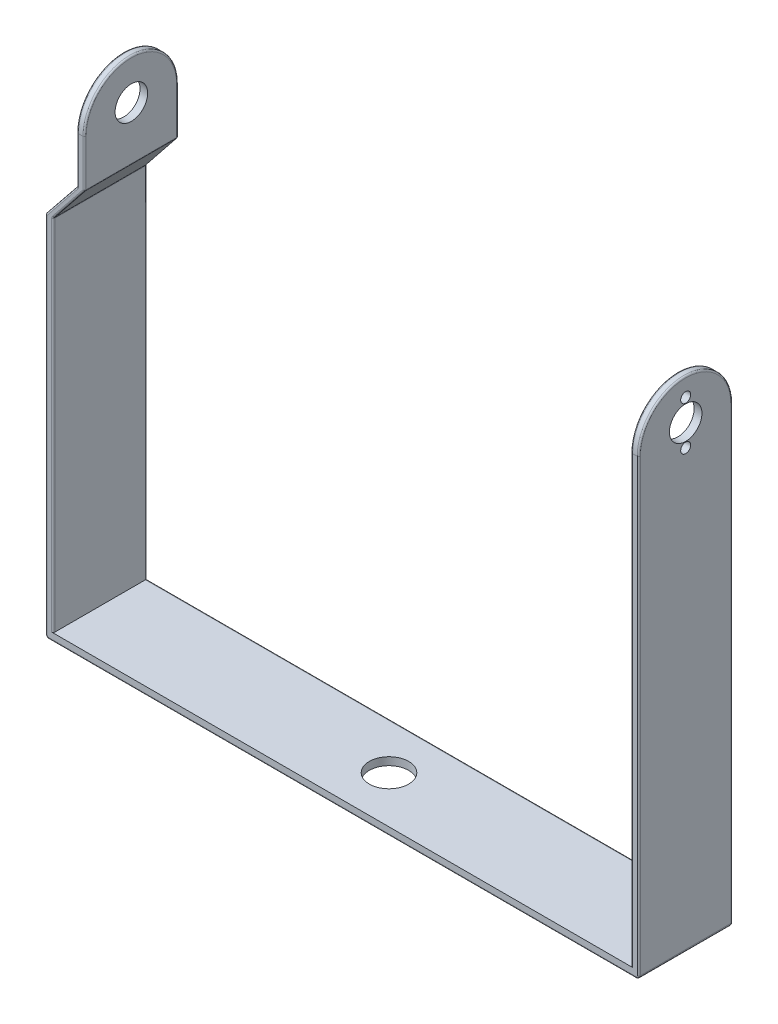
ISO-10303-21;
HEADER;
FILE_DESCRIPTION(('STEP AP214'),'2;1');
FILE_NAME('part.step','',(''),(''),'','','');
FILE_SCHEMA(('AUTOMOTIVE_DESIGN { 1 0 10303 214 1 1 1 1 }'));
ENDSEC;
DATA;
#1=APPLICATION_CONTEXT('core data for automotive mechanical design processes');
#2=APPLICATION_PROTOCOL_DEFINITION('international standard','automotive_design',2000,#1);
#3=PRODUCT_CONTEXT('',#1,'mechanical');
#4=PRODUCT('Part','Part','',(#3));
#5=PRODUCT_RELATED_PRODUCT_CATEGORY('part','',(#4));
#6=PRODUCT_DEFINITION_FORMATION('','',#4);
#7=PRODUCT_DEFINITION_CONTEXT('part definition',#1,'design');
#8=PRODUCT_DEFINITION('design','',#6,#7);
#9=PRODUCT_DEFINITION_SHAPE('','',#8);
#10=(LENGTH_UNIT() NAMED_UNIT(*) SI_UNIT(.MILLI.,.METRE.));
#11=(NAMED_UNIT(*) PLANE_ANGLE_UNIT() SI_UNIT($,.RADIAN.));
#12=(NAMED_UNIT(*) SI_UNIT($,.STERADIAN.) SOLID_ANGLE_UNIT());
#13=UNCERTAINTY_MEASURE_WITH_UNIT(LENGTH_MEASURE(1.E-05),#10,'distance_accuracy_value','');
#14=(GEOMETRIC_REPRESENTATION_CONTEXT(3) GLOBAL_UNCERTAINTY_ASSIGNED_CONTEXT((#13)) GLOBAL_UNIT_ASSIGNED_CONTEXT((#10,
#11,#12)) REPRESENTATION_CONTEXT('',''));
#15=CARTESIAN_POINT('',(0.,0.,0.));
#16=DIRECTION('',(0.,0.,1.));
#17=DIRECTION('',(1.,0.,0.));
#18=AXIS2_PLACEMENT_3D('',#15,#16,#17);
#19=CARTESIAN_POINT('',(-177.5,-113.347270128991,30.));
#20=DIRECTION('',(1.,0.,0.));
#21=DIRECTION('',(0.,1.,0.));
#22=AXIS2_PLACEMENT_3D('',#19,#20,#21);
#23=PLANE('',#22);
#24=DIRECTION('',(0.,0.,1.));
#25=VECTOR('',#24,1.);
#26=CARTESIAN_POINT('',(-177.5,130.175390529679,30.));
#27=LINE('',#26,#25);
#28=CARTESIAN_POINT('',(-177.5,130.175390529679,29.5));
#29=VERTEX_POINT('',#28);
#30=CARTESIAN_POINT('',(-177.5,130.175390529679,0.5));
#31=VERTEX_POINT('',#30);
#32=EDGE_CURVE('E405',#29,#31,#27,.F.);
#33=ORIENTED_EDGE('',*,*,#32,.T.);
#34=DIRECTION('',(0.,-1.,0.));
#35=VECTOR('',#34,1.);
#36=CARTESIAN_POINT('',(-177.5,145.,0.5));
#37=LINE('',#36,#35);
#38=CARTESIAN_POINT('',(-177.5,145.,0.499999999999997));
#39=VERTEX_POINT('',#38);
#40=EDGE_CURVE('E411',#31,#39,#37,.F.);
#41=ORIENTED_EDGE('',*,*,#40,.T.);
#42=CARTESIAN_POINT('',(-177.5,145.,15.));
#43=DIRECTION('',(1.,0.,0.));
#44=DIRECTION('',(0.,1.,0.));
#45=AXIS2_PLACEMENT_3D('',#42,#43,#44);
#46=CIRCLE('',#45,14.5);
#47=CARTESIAN_POINT('',(-177.5,145.,29.5));
#48=VERTEX_POINT('',#47);
#49=EDGE_CURVE('E409',#39,#48,#46,.T.);
#50=ORIENTED_EDGE('',*,*,#49,.T.);
#51=DIRECTION('',(0.,-1.,0.));
#52=VECTOR('',#51,1.);
#53=CARTESIAN_POINT('',(-177.5,-113.347270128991,29.5));
#54=LINE('',#53,#52);
#55=EDGE_CURVE('E407',#48,#29,#54,.T.);
#56=ORIENTED_EDGE('',*,*,#55,.T.);
#57=EDGE_LOOP('',(#33,#41,#50,#56));
#58=FACE_BOUND('',#57,.T.);
#59=CARTESIAN_POINT('',(-177.5,147.1,15.));
#60=DIRECTION('',(1.,0.,0.));
#61=DIRECTION('',(0.,1.,0.));
#62=AXIS2_PLACEMENT_3D('',#59,#60,#61);
#63=CIRCLE('',#62,5.21);
#64=CARTESIAN_POINT('',(-177.5,152.31,15.));
#65=VERTEX_POINT('',#64);
#66=EDGE_CURVE('E514',#65,#65,#63,.T.);
#67=ORIENTED_EDGE('',*,*,#66,.F.);
#68=EDGE_LOOP('',(#67));
#69=FACE_BOUND('',#68,.T.);
#70=ADVANCED_FACE('F66',(#58,#69),#23,.T.);
#71=CARTESIAN_POINT('',(-2.49999999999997,-113.347270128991,30.));
#72=DIRECTION('',(-1.,0.,0.));
#73=DIRECTION('',(0.,-1.,0.));
#74=AXIS2_PLACEMENT_3D('',#71,#72,#73);
#75=PLANE('',#74);
#76=CARTESIAN_POINT('',(-2.49999999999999,154.1,15.));
#77=DIRECTION('',(-1.,0.,0.));
#78=DIRECTION('',(0.,-1.,0.));
#79=AXIS2_PLACEMENT_3D('',#76,#77,#78);
#80=CIRCLE('',#79,1.6);
#81=CARTESIAN_POINT('',(-2.49999999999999,152.5,15.));
#82=VERTEX_POINT('',#81);
#83=EDGE_CURVE('E799',#82,#82,#80,.T.);
#84=ORIENTED_EDGE('',*,*,#83,.F.);
#85=EDGE_LOOP('',(#84));
#86=FACE_BOUND('',#85,.T.);
#87=CARTESIAN_POINT('',(-2.49999999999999,140.1,15.));
#88=DIRECTION('',(-1.,0.,0.));
#89=DIRECTION('',(0.,-1.,0.));
#90=AXIS2_PLACEMENT_3D('',#87,#88,#89);
#91=CIRCLE('',#90,1.6);
#92=CARTESIAN_POINT('',(-2.49999999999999,138.5,15.));
#93=VERTEX_POINT('',#92);
#94=EDGE_CURVE('E791',#93,#93,#91,.T.);
#95=ORIENTED_EDGE('',*,*,#94,.F.);
#96=EDGE_LOOP('',(#95));
#97=FACE_BOUND('',#96,.T.);
#98=CARTESIAN_POINT('',(-2.49999999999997,147.1,15.));
#99=DIRECTION('',(-1.,0.,0.));
#100=DIRECTION('',(0.,-1.,0.));
#101=AXIS2_PLACEMENT_3D('',#98,#99,#100);
#102=CIRCLE('',#101,5.21);
#103=CARTESIAN_POINT('',(-2.49999999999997,141.89,15.));
#104=VERTEX_POINT('',#103);
#105=EDGE_CURVE('E628',#104,#104,#102,.T.);
#106=ORIENTED_EDGE('',*,*,#105,.F.);
#107=EDGE_LOOP('',(#106));
#108=FACE_BOUND('',#107,.T.);
#109=DIRECTION('',(0.,0.,-1.));
#110=VECTOR('',#109,1.);
#111=CARTESIAN_POINT('',(-2.49999999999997,2.5,30.));
#112=LINE('',#111,#110);
#113=CARTESIAN_POINT('',(-2.49999999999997,2.5,29.5));
#114=VERTEX_POINT('',#113);
#115=CARTESIAN_POINT('',(-2.49999999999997,2.5,0.5));
#116=VERTEX_POINT('',#115);
#117=EDGE_CURVE('E465',#114,#116,#112,.T.);
#118=ORIENTED_EDGE('',*,*,#117,.F.);
#119=DIRECTION('',(0.,1.,0.));
#120=VECTOR('',#119,1.);
#121=CARTESIAN_POINT('',(-2.49999999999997,-113.347270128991,29.5));
#122=LINE('',#121,#120);
#123=CARTESIAN_POINT('',(-2.49999999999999,145.,29.5));
#124=VERTEX_POINT('',#123);
#125=EDGE_CURVE('E403',#114,#124,#122,.T.);
#126=ORIENTED_EDGE('',*,*,#125,.T.);
#127=CARTESIAN_POINT('',(-2.49999999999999,145.,15.));
#128=DIRECTION('',(-1.,0.,0.));
#129=DIRECTION('',(0.,-1.,0.));
#130=AXIS2_PLACEMENT_3D('',#127,#128,#129);
#131=CIRCLE('',#130,14.5);
#132=CARTESIAN_POINT('',(-2.49999999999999,145.,0.5));
#133=VERTEX_POINT('',#132);
#134=EDGE_CURVE('E401',#124,#133,#131,.T.);
#135=ORIENTED_EDGE('',*,*,#134,.T.);
#136=DIRECTION('',(0.,1.,0.));
#137=VECTOR('',#136,1.);
#138=CARTESIAN_POINT('',(-2.49999999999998,2.5,0.5));
#139=LINE('',#138,#137);
#140=EDGE_CURVE('E399',#133,#116,#139,.F.);
#141=ORIENTED_EDGE('',*,*,#140,.T.);
#142=EDGE_LOOP('',(#118,#126,#135,#141));
#143=FACE_BOUND('',#142,.T.);
#144=ADVANCED_FACE('F68',(#86,#97,#108,#143),#75,.T.);
#145=CARTESIAN_POINT('',(0.,-113.347270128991,30.));
#146=DIRECTION('',(1.,0.,0.));
#147=DIRECTION('',(0.,1.,0.));
#148=AXIS2_PLACEMENT_3D('',#145,#146,#147);
#149=PLANE('',#148);
#150=CARTESIAN_POINT('',(0.,154.1,15.));
#151=DIRECTION('',(1.,0.,0.));
#152=DIRECTION('',(0.,-1.,0.));
#153=AXIS2_PLACEMENT_3D('',#150,#151,#152);
#154=CIRCLE('',#153,1.6);
#155=CARTESIAN_POINT('',(0.,152.5,15.));
#156=VERTEX_POINT('',#155);
#157=EDGE_CURVE('E802',#156,#156,#154,.T.);
#158=ORIENTED_EDGE('',*,*,#157,.F.);
#159=EDGE_LOOP('',(#158));
#160=FACE_BOUND('',#159,.T.);
#161=CARTESIAN_POINT('',(0.,140.1,15.));
#162=DIRECTION('',(1.,0.,0.));
#163=DIRECTION('',(0.,1.,0.));
#164=AXIS2_PLACEMENT_3D('',#161,#162,#163);
#165=CIRCLE('',#164,1.6);
#166=CARTESIAN_POINT('',(0.,141.7,15.));
#167=VERTEX_POINT('',#166);
#168=EDGE_CURVE('E796',#167,#167,#165,.T.);
#169=ORIENTED_EDGE('',*,*,#168,.F.);
#170=EDGE_LOOP('',(#169));
#171=FACE_BOUND('',#170,.T.);
#172=CARTESIAN_POINT('',(0.,147.1,15.));
#173=DIRECTION('',(1.,0.,0.));
#174=DIRECTION('',(0.,1.,0.));
#175=AXIS2_PLACEMENT_3D('',#172,#173,#174);
#176=CIRCLE('',#175,5.21);
#177=CARTESIAN_POINT('',(0.,152.31,15.));
#178=VERTEX_POINT('',#177);
#179=EDGE_CURVE('E624',#178,#178,#176,.T.);
#180=ORIENTED_EDGE('',*,*,#179,.F.);
#181=EDGE_LOOP('',(#180));
#182=FACE_BOUND('',#181,.T.);
#183=DIRECTION('',(0.,0.,-1.));
#184=VECTOR('',#183,1.);
#185=CARTESIAN_POINT('',(0.,1.,0.));
#186=LINE('',#185,#184);
#187=CARTESIAN_POINT('',(0.,1.,29.5));
#188=VERTEX_POINT('',#187);
#189=CARTESIAN_POINT('',(0.,1.,0.5));
#190=VERTEX_POINT('',#189);
#191=EDGE_CURVE('E642',#188,#190,#186,.T.);
#192=ORIENTED_EDGE('',*,*,#191,.T.);
#193=DIRECTION('',(0.,-1.,0.));
#194=VECTOR('',#193,1.);
#195=CARTESIAN_POINT('',(0.,145.,0.5));
#196=LINE('',#195,#194);
#197=CARTESIAN_POINT('',(0.,145.,0.499999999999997));
#198=VERTEX_POINT('',#197);
#199=EDGE_CURVE('E437',#190,#198,#196,.F.);
#200=ORIENTED_EDGE('',*,*,#199,.T.);
#201=CARTESIAN_POINT('',(0.,145.,15.));
#202=DIRECTION('',(1.,0.,0.));
#203=DIRECTION('',(0.,1.,0.));
#204=AXIS2_PLACEMENT_3D('',#201,#202,#203);
#205=CIRCLE('',#204,14.5);
#206=CARTESIAN_POINT('',(0.,145.,29.5));
#207=VERTEX_POINT('',#206);
#208=EDGE_CURVE('E435',#198,#207,#205,.T.);
#209=ORIENTED_EDGE('',*,*,#208,.T.);
#210=DIRECTION('',(0.,-1.,0.));
#211=VECTOR('',#210,1.);
#212=CARTESIAN_POINT('',(0.,-113.347270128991,29.5));
#213=LINE('',#212,#211);
#214=EDGE_CURVE('E433',#207,#188,#213,.T.);
#215=ORIENTED_EDGE('',*,*,#214,.T.);
#216=EDGE_LOOP('',(#192,#200,#209,#215));
#217=FACE_BOUND('',#216,.T.);
#218=ADVANCED_FACE('F750',(#160,#171,#182,#217),#149,.T.);
#219=CARTESIAN_POINT('',(-179.93840728,-113.347270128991,0.));
#220=DIRECTION('',(1.,0.,0.));
#221=DIRECTION('',(0.,0.,-1.));
#222=AXIS2_PLACEMENT_3D('',#219,#220,#221);
#223=PLANE('',#222);
#224=DIRECTION('',(0.,1.,0.));
#225=VECTOR('',#224,1.);
#226=CARTESIAN_POINT('',(-179.93840728,145.,29.5));
#227=LINE('',#226,#225);
#228=CARTESIAN_POINT('',(-179.93840728,130.17623250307,29.5));
#229=VERTEX_POINT('',#228);
#230=CARTESIAN_POINT('',(-179.93840728,145.,29.5));
#231=VERTEX_POINT('',#230);
#232=EDGE_CURVE('E331',#229,#231,#227,.T.);
#233=ORIENTED_EDGE('',*,*,#232,.T.);
#234=CARTESIAN_POINT('',(-179.93840728,145.,15.));
#235=DIRECTION('',(1.,0.,0.));
#236=DIRECTION('',(0.,0.,-1.));
#237=AXIS2_PLACEMENT_3D('',#234,#235,#236);
#238=CIRCLE('',#237,14.5);
#239=CARTESIAN_POINT('',(-179.93840728,145.,0.5));
#240=VERTEX_POINT('',#239);
#241=EDGE_CURVE('E337',#231,#240,#238,.F.);
#242=ORIENTED_EDGE('',*,*,#241,.T.);
#243=DIRECTION('',(0.,1.,0.));
#244=VECTOR('',#243,1.);
#245=CARTESIAN_POINT('',(-179.93840728,-113.347270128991,0.5));
#246=LINE('',#245,#244);
#247=CARTESIAN_POINT('',(-179.93840728,130.17623250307,0.5));
#248=VERTEX_POINT('',#247);
#249=EDGE_CURVE('E319',#240,#248,#246,.F.);
#250=ORIENTED_EDGE('',*,*,#249,.T.);
#251=DIRECTION('',(0.,0.,1.));
#252=VECTOR('',#251,1.);
#253=CARTESIAN_POINT('',(-179.93840728,130.17623250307,30.));
#254=LINE('',#253,#252);
#255=EDGE_CURVE('E329',#248,#229,#254,.T.);
#256=ORIENTED_EDGE('',*,*,#255,.T.);
#257=EDGE_LOOP('',(#233,#242,#250,#256));
#258=FACE_BOUND('',#257,.T.);
#259=CARTESIAN_POINT('',(-179.93840728,147.1,15.));
#260=DIRECTION('',(1.,0.,0.));
#261=DIRECTION('',(0.,0.,-1.));
#262=AXIS2_PLACEMENT_3D('',#259,#260,#261);
#263=CIRCLE('',#262,5.21);
#264=CARTESIAN_POINT('',(-179.93840728,147.1,9.79));
#265=VERTEX_POINT('',#264);
#266=EDGE_CURVE('E627',#265,#265,#263,.T.);
#267=ORIENTED_EDGE('',*,*,#266,.T.);
#268=EDGE_LOOP('',(#267));
#269=FACE_BOUND('',#268,.T.);
#270=ADVANCED_FACE('F696',(#258,#269),#223,.F.);
#271=CARTESIAN_POINT('',(-95.,-113.347270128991,30.));
#272=DIRECTION('',(0.,0.,1.));
#273=DIRECTION('',(1.,0.,0.));
#274=AXIS2_PLACEMENT_3D('',#271,#272,#273);
#275=PLANE('',#274);
#276=DIRECTION('',(1.,0.,0.));
#277=VECTOR('',#276,1.);
#278=CARTESIAN_POINT('',(-190.,145.,30.));
#279=LINE('',#278,#277);
#280=CARTESIAN_POINT('',(-1.99999999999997,145.,30.));
#281=VERTEX_POINT('',#280);
#282=CARTESIAN_POINT('',(-0.5,145.,30.));
#283=VERTEX_POINT('',#282);
#284=EDGE_CURVE('E620',#281,#283,#279,.T.);
#285=ORIENTED_EDGE('',*,*,#284,.F.);
#286=DIRECTION('',(0.,1.,0.));
#287=VECTOR('',#286,1.);
#288=CARTESIAN_POINT('',(-1.99999999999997,-113.347270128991,30.));
#289=LINE('',#288,#287);
#290=CARTESIAN_POINT('',(-1.99999999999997,2.5,30.));
#291=VERTEX_POINT('',#290);
#292=EDGE_CURVE('E396',#281,#291,#289,.F.);
#293=ORIENTED_EDGE('',*,*,#292,.T.);
#294=DIRECTION('',(1.,0.,0.));
#295=VECTOR('',#294,1.);
#296=CARTESIAN_POINT('',(-95.,2.5,30.));
#297=LINE('',#296,#295);
#298=CARTESIAN_POINT('',(-188.,2.5,30.));
#299=VERTEX_POINT('',#298);
#300=EDGE_CURVE('E467',#299,#291,#297,.T.);
#301=ORIENTED_EDGE('',*,*,#300,.F.);
#302=DIRECTION('',(0.,-1.,0.));
#303=VECTOR('',#302,1.);
#304=CARTESIAN_POINT('',(-188.,117.5,30.));
#305=LINE('',#304,#303);
#306=CARTESIAN_POINT('',(-188.,117.324609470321,30.));
#307=VERTEX_POINT('',#306);
#308=EDGE_CURVE('E373',#299,#307,#305,.F.);
#309=ORIENTED_EDGE('',*,*,#308,.T.);
#310=CARTESIAN_POINT('',(-187.,117.324609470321,30.));
#311=DIRECTION('',(0.,0.,1.));
#312=DIRECTION('',(1.,0.,0.));
#313=AXIS2_PLACEMENT_3D('',#310,#311,#312);
#314=CIRCLE('',#313,1.);
#315=CARTESIAN_POINT('',(-187.780868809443,117.949304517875,30.));
#316=VERTEX_POINT('',#315);
#317=EDGE_CURVE('E370',#316,#307,#314,.T.);
#318=ORIENTED_EDGE('',*,*,#317,.F.);
#319=DIRECTION('',(0.624695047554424,0.780868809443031,0.));
#320=VECTOR('',#319,1.);
#321=CARTESIAN_POINT('',(-264.401297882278,22.1737681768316,30.));
#322=LINE('',#321,#320);
#323=CARTESIAN_POINT('',(-178.,130.175390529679,30.));
#324=VERTEX_POINT('',#323);
#325=EDGE_CURVE('E375',#316,#324,#322,.T.);
#326=ORIENTED_EDGE('',*,*,#325,.T.);
#327=DIRECTION('',(0.,-1.,0.));
#328=VECTOR('',#327,1.);
#329=CARTESIAN_POINT('',(-178.,-113.347270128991,30.));
#330=LINE('',#329,#328);
#331=CARTESIAN_POINT('',(-178.,145.,30.));
#332=VERTEX_POINT('',#331);
#333=EDGE_CURVE('E377',#324,#332,#330,.F.);
#334=ORIENTED_EDGE('',*,*,#333,.T.);
#335=CARTESIAN_POINT('',(-179.43840728,145.,30.));
#336=VERTEX_POINT('',#335);
#337=EDGE_CURVE('E623',#336,#332,#279,.T.);
#338=ORIENTED_EDGE('',*,*,#337,.F.);
#339=DIRECTION('',(0.,1.,0.));
#340=VECTOR('',#339,1.);
#341=CARTESIAN_POINT('',(-179.43840728,130.,30.));
#342=LINE('',#341,#340);
#343=CARTESIAN_POINT('',(-179.43840728,130.17623250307,30.));
#344=VERTEX_POINT('',#343);
#345=EDGE_CURVE('E394',#336,#344,#342,.F.);
#346=ORIENTED_EDGE('',*,*,#345,.T.);
#347=CARTESIAN_POINT('',(-180.43840728,130.17623250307,30.));
#348=DIRECTION('',(0.,0.,1.));
#349=DIRECTION('',(1.,0.,0.));
#350=AXIS2_PLACEMENT_3D('',#347,#348,#349);
#351=CIRCLE('',#350,1.);
#352=CARTESIAN_POINT('',(-179.659414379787,129.549199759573,30.));
#353=VERTEX_POINT('',#352);
#354=EDGE_CURVE('E391',#353,#344,#351,.T.);
#355=ORIENTED_EDGE('',*,*,#354,.F.);
#356=DIRECTION('',(0.627032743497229,0.77899290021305,0.));
#357=VECTOR('',#356,1.);
#358=CARTESIAN_POINT('',(-189.610503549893,117.186483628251,30.));
#359=LINE('',#358,#357);
#360=CARTESIAN_POINT('',(-189.5,117.32376749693,30.));
#361=VERTEX_POINT('',#360);
#362=EDGE_CURVE('E381',#353,#361,#359,.F.);
#363=ORIENTED_EDGE('',*,*,#362,.T.);
#364=DIRECTION('',(0.,-1.,0.));
#365=VECTOR('',#364,1.);
#366=CARTESIAN_POINT('',(-189.5,1.,30.));
#367=LINE('',#366,#365);
#368=CARTESIAN_POINT('',(-189.5,1.,30.));
#369=VERTEX_POINT('',#368);
#370=EDGE_CURVE('E379',#361,#369,#367,.T.);
#371=ORIENTED_EDGE('',*,*,#370,.T.);
#372=CARTESIAN_POINT('',(-189.,1.,30.));
#373=DIRECTION('',(0.,0.,1.));
#374=DIRECTION('',(1.,0.,0.));
#375=AXIS2_PLACEMENT_3D('',#372,#373,#374);
#376=CIRCLE('',#375,0.5);
#377=CARTESIAN_POINT('',(-189.,0.5,30.));
#378=VERTEX_POINT('',#377);
#379=EDGE_CURVE('E383',#369,#378,#376,.T.);
#380=ORIENTED_EDGE('',*,*,#379,.T.);
#381=DIRECTION('',(1.,0.,0.));
#382=VECTOR('',#381,1.);
#383=CARTESIAN_POINT('',(-1.,0.5,30.));
#384=LINE('',#383,#382);
#385=CARTESIAN_POINT('',(-1.,0.5,30.));
#386=VERTEX_POINT('',#385);
#387=EDGE_CURVE('E385',#378,#386,#384,.T.);
#388=ORIENTED_EDGE('',*,*,#387,.T.);
#389=CARTESIAN_POINT('',(-1.,1.,30.));
#390=DIRECTION('',(0.,0.,1.));
#391=DIRECTION('',(1.,0.,0.));
#392=AXIS2_PLACEMENT_3D('',#389,#390,#391);
#393=CIRCLE('',#392,0.5);
#394=CARTESIAN_POINT('',(-0.5,1.,30.));
#395=VERTEX_POINT('',#394);
#396=EDGE_CURVE('E387',#386,#395,#393,.T.);
#397=ORIENTED_EDGE('',*,*,#396,.T.);
#398=DIRECTION('',(0.,-1.,0.));
#399=VECTOR('',#398,1.);
#400=CARTESIAN_POINT('',(-0.5,-113.347270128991,30.));
#401=LINE('',#400,#399);
#402=EDGE_CURVE('E389',#395,#283,#401,.F.);
#403=ORIENTED_EDGE('',*,*,#402,.T.);
#404=EDGE_LOOP('',(#285,#293,#301,#309,#318,#326,#334,#338,#346,#355,#363,#371,#380,#388,#397,#403));
#405=FACE_BOUND('',#404,.T.);
#406=ADVANCED_FACE('F703',(#405),#275,.T.);
#407=CARTESIAN_POINT('',(-95.,-113.347270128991,0.));
#408=DIRECTION('',(0.,0.,1.));
#409=DIRECTION('',(1.,0.,0.));
#410=AXIS2_PLACEMENT_3D('',#407,#408,#409);
#411=PLANE('',#410);
#412=DIRECTION('',(1.,0.,0.));
#413=VECTOR('',#412,1.);
#414=CARTESIAN_POINT('',(-190.,145.,0.));
#415=LINE('',#414,#413);
#416=CARTESIAN_POINT('',(-1.99999999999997,145.,0.));
#417=VERTEX_POINT('',#416);
#418=CARTESIAN_POINT('',(-0.5,145.,0.));
#419=VERTEX_POINT('',#418);
#420=EDGE_CURVE('E314',#417,#419,#415,.T.);
#421=ORIENTED_EDGE('',*,*,#420,.T.);
#422=DIRECTION('',(0.,-1.,0.));
#423=VECTOR('',#422,1.);
#424=CARTESIAN_POINT('',(-0.5,1.,0.));
#425=LINE('',#424,#423);
#426=CARTESIAN_POINT('',(-0.5,1.,0.));
#427=VERTEX_POINT('',#426);
#428=EDGE_CURVE('E362',#419,#427,#425,.T.);
#429=ORIENTED_EDGE('',*,*,#428,.T.);
#430=CARTESIAN_POINT('',(-1.,1.,0.));
#431=DIRECTION('',(0.,0.,1.));
#432=DIRECTION('',(1.,0.,0.));
#433=AXIS2_PLACEMENT_3D('',#430,#431,#432);
#434=CIRCLE('',#433,0.5);
#435=CARTESIAN_POINT('',(-1.,0.5,0.));
#436=VERTEX_POINT('',#435);
#437=EDGE_CURVE('E360',#427,#436,#434,.F.);
#438=ORIENTED_EDGE('',*,*,#437,.T.);
#439=DIRECTION('',(1.,0.,0.));
#440=VECTOR('',#439,1.);
#441=CARTESIAN_POINT('',(-95.,0.5,0.));
#442=LINE('',#441,#440);
#443=CARTESIAN_POINT('',(-189.,0.5,0.));
#444=VERTEX_POINT('',#443);
#445=EDGE_CURVE('E358',#436,#444,#442,.F.);
#446=ORIENTED_EDGE('',*,*,#445,.T.);
#447=CARTESIAN_POINT('',(-189.,1.,0.));
#448=DIRECTION('',(0.,0.,1.));
#449=DIRECTION('',(1.,0.,0.));
#450=AXIS2_PLACEMENT_3D('',#447,#448,#449);
#451=CIRCLE('',#450,0.5);
#452=CARTESIAN_POINT('',(-189.5,1.,0.));
#453=VERTEX_POINT('',#452);
#454=EDGE_CURVE('E302',#444,#453,#451,.F.);
#455=ORIENTED_EDGE('',*,*,#454,.T.);
#456=DIRECTION('',(0.,-1.,0.));
#457=VECTOR('',#456,1.);
#458=CARTESIAN_POINT('',(-189.5,-113.347270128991,0.));
#459=LINE('',#458,#457);
#460=CARTESIAN_POINT('',(-189.5,117.32376749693,0.));
#461=VERTEX_POINT('',#460);
#462=EDGE_CURVE('E303',#453,#461,#459,.F.);
#463=ORIENTED_EDGE('',*,*,#462,.T.);
#464=DIRECTION('',(0.627032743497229,0.77899290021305,0.));
#465=VECTOR('',#464,1.);
#466=CARTESIAN_POINT('',(-265.017632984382,23.5045841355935,0.));
#467=LINE('',#466,#465);
#468=CARTESIAN_POINT('',(-179.659414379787,129.549199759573,0.));
#469=VERTEX_POINT('',#468);
#470=EDGE_CURVE('E354',#461,#469,#467,.T.);
#471=ORIENTED_EDGE('',*,*,#470,.T.);
#472=CARTESIAN_POINT('',(-180.43840728,130.17623250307,0.));
#473=DIRECTION('',(0.,0.,1.));
#474=DIRECTION('',(1.,0.,0.));
#475=AXIS2_PLACEMENT_3D('',#472,#473,#474);
#476=CIRCLE('',#475,1.);
#477=CARTESIAN_POINT('',(-179.43840728,130.17623250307,0.));
#478=VERTEX_POINT('',#477);
#479=EDGE_CURVE('E297',#478,#469,#476,.F.);
#480=ORIENTED_EDGE('',*,*,#479,.F.);
#481=DIRECTION('',(0.,1.,0.));
#482=VECTOR('',#481,1.);
#483=CARTESIAN_POINT('',(-179.43840728,-113.347270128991,0.));
#484=LINE('',#483,#482);
#485=CARTESIAN_POINT('',(-179.43840728,145.,0.));
#486=VERTEX_POINT('',#485);
#487=EDGE_CURVE('E290',#478,#486,#484,.T.);
#488=ORIENTED_EDGE('',*,*,#487,.T.);
#489=CARTESIAN_POINT('',(-178.,145.,0.));
#490=VERTEX_POINT('',#489);
#491=EDGE_CURVE('E294',#486,#490,#415,.T.);
#492=ORIENTED_EDGE('',*,*,#491,.T.);
#493=DIRECTION('',(0.,-1.,0.));
#494=VECTOR('',#493,1.);
#495=CARTESIAN_POINT('',(-178.,130.,0.));
#496=LINE('',#495,#494);
#497=CARTESIAN_POINT('',(-178.,130.175390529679,0.));
#498=VERTEX_POINT('',#497);
#499=EDGE_CURVE('E344',#490,#498,#496,.T.);
#500=ORIENTED_EDGE('',*,*,#499,.T.);
#501=DIRECTION('',(0.624695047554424,0.780868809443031,0.));
#502=VECTOR('',#501,1.);
#503=CARTESIAN_POINT('',(-187.890434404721,117.812347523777,0.));
#504=LINE('',#503,#502);
#505=CARTESIAN_POINT('',(-187.780868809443,117.949304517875,0.));
#506=VERTEX_POINT('',#505);
#507=EDGE_CURVE('E342',#498,#506,#504,.F.);
#508=ORIENTED_EDGE('',*,*,#507,.T.);
#509=CARTESIAN_POINT('',(-187.,117.324609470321,0.));
#510=DIRECTION('',(0.,0.,1.));
#511=DIRECTION('',(1.,0.,0.));
#512=AXIS2_PLACEMENT_3D('',#509,#510,#511);
#513=CIRCLE('',#512,1.);
#514=CARTESIAN_POINT('',(-188.,117.324609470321,0.));
#515=VERTEX_POINT('',#514);
#516=EDGE_CURVE('E339',#515,#506,#513,.F.);
#517=ORIENTED_EDGE('',*,*,#516,.F.);
#518=DIRECTION('',(0.,-1.,0.));
#519=VECTOR('',#518,1.);
#520=CARTESIAN_POINT('',(-188.,-113.347270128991,0.));
#521=LINE('',#520,#519);
#522=CARTESIAN_POINT('',(-188.,2.,0.));
#523=VERTEX_POINT('',#522);
#524=EDGE_CURVE('E346',#515,#523,#521,.T.);
#525=ORIENTED_EDGE('',*,*,#524,.T.);
#526=DIRECTION('',(1.,0.,0.));
#527=VECTOR('',#526,1.);
#528=CARTESIAN_POINT('',(-2.49999999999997,2.,0.));
#529=LINE('',#528,#527);
#530=CARTESIAN_POINT('',(-1.99999999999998,2.,0.));
#531=VERTEX_POINT('',#530);
#532=EDGE_CURVE('E349',#523,#531,#529,.T.);
#533=ORIENTED_EDGE('',*,*,#532,.T.);
#534=DIRECTION('',(0.,1.,0.));
#535=VECTOR('',#534,1.);
#536=CARTESIAN_POINT('',(-1.99999999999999,145.,0.));
#537=LINE('',#536,#535);
#538=EDGE_CURVE('E351',#531,#417,#537,.T.);
#539=ORIENTED_EDGE('',*,*,#538,.T.);
#540=EDGE_LOOP('',(#421,#429,#438,#446,#455,#463,#471,#480,#488,#492,#500,#508,#517,#525,#533,#539));
#541=FACE_BOUND('',#540,.T.);
#542=ADVANCED_FACE('F293',(#541),#411,.F.);
#543=CARTESIAN_POINT('',(-95.,2.5,30.));
#544=DIRECTION('',(0.,1.,0.));
#545=DIRECTION('',(-1.,0.,0.));
#546=AXIS2_PLACEMENT_3D('',#543,#544,#545);
#547=PLANE('',#546);
#548=CARTESIAN_POINT('',(-95.,2.5,15.));
#549=DIRECTION('',(0.,1.,0.));
#550=DIRECTION('',(-1.,0.,0.));
#551=AXIS2_PLACEMENT_3D('',#548,#549,#550);
#552=CIRCLE('',#551,6.3);
#553=CARTESIAN_POINT('',(-101.3,2.5,15.));
#554=VERTEX_POINT('',#553);
#555=EDGE_CURVE('E524',#554,#554,#552,.T.);
#556=ORIENTED_EDGE('',*,*,#555,.F.);
#557=EDGE_LOOP('',(#556));
#558=FACE_BOUND('',#557,.T.);
#559=ORIENTED_EDGE('',*,*,#117,.T.);
#560=DIRECTION('',(1.,0.,0.));
#561=VECTOR('',#560,1.);
#562=CARTESIAN_POINT('',(-187.5,2.5,0.5));
#563=LINE('',#562,#561);
#564=CARTESIAN_POINT('',(-187.5,2.5,0.5));
#565=VERTEX_POINT('',#564);
#566=EDGE_CURVE('E443',#116,#565,#563,.F.);
#567=ORIENTED_EDGE('',*,*,#566,.T.);
#568=DIRECTION('',(0.,0.,1.));
#569=VECTOR('',#568,1.);
#570=CARTESIAN_POINT('',(-187.5,2.5,0.));
#571=LINE('',#570,#569);
#572=CARTESIAN_POINT('',(-187.5,2.5,29.5));
#573=VERTEX_POINT('',#572);
#574=EDGE_CURVE('E507',#565,#573,#571,.T.);
#575=ORIENTED_EDGE('',*,*,#574,.T.);
#576=CARTESIAN_POINT('',(-188.,2.5,29.5));
#577=DIRECTION('',(0.,1.,0.));
#578=DIRECTION('',(-1.,0.,0.));
#579=AXIS2_PLACEMENT_3D('',#576,#577,#578);
#580=CIRCLE('',#579,0.5);
#581=EDGE_CURVE('E12',#573,#299,#580,.F.);
#582=ORIENTED_EDGE('',*,*,#581,.T.);
#583=ORIENTED_EDGE('',*,*,#300,.T.);
#584=CARTESIAN_POINT('',(-1.99999999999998,2.5,29.5));
#585=DIRECTION('',(0.,1.,0.));
#586=DIRECTION('',(-1.,0.,0.));
#587=AXIS2_PLACEMENT_3D('',#584,#585,#586);
#588=CIRCLE('',#587,0.5);
#589=EDGE_CURVE('E74',#291,#114,#588,.F.);
#590=ORIENTED_EDGE('',*,*,#589,.T.);
#591=EDGE_LOOP('',(#559,#567,#575,#582,#583,#590));
#592=FACE_BOUND('',#591,.T.);
#593=ADVANCED_FACE('F464',(#558,#592),#547,.T.);
#594=CARTESIAN_POINT('',(-190.,-113.347270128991,30.));
#595=DIRECTION('',(1.,0.,0.));
#596=DIRECTION('',(0.,0.,-1.));
#597=AXIS2_PLACEMENT_3D('',#594,#595,#596);
#598=PLANE('',#597);
#599=DIRECTION('',(0.,0.,1.));
#600=VECTOR('',#599,1.);
#601=CARTESIAN_POINT('',(-190.,117.32376749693,30.));
#602=LINE('',#601,#600);
#603=CARTESIAN_POINT('',(-190.,117.32376749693,29.5));
#604=VERTEX_POINT('',#603);
#605=CARTESIAN_POINT('',(-190.,117.32376749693,0.5));
#606=VERTEX_POINT('',#605);
#607=EDGE_CURVE('E414',#604,#606,#602,.F.);
#608=ORIENTED_EDGE('',*,*,#607,.T.);
#609=DIRECTION('',(0.,-1.,0.));
#610=VECTOR('',#609,1.);
#611=CARTESIAN_POINT('',(-190.,-113.347270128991,0.5));
#612=LINE('',#611,#610);
#613=CARTESIAN_POINT('',(-190.,1.,0.5));
#614=VERTEX_POINT('',#613);
#615=EDGE_CURVE('E418',#606,#614,#612,.T.);
#616=ORIENTED_EDGE('',*,*,#615,.T.);
#617=DIRECTION('',(0.,0.,-1.));
#618=VECTOR('',#617,1.);
#619=CARTESIAN_POINT('',(-190.,1.,30.));
#620=LINE('',#619,#618);
#621=CARTESIAN_POINT('',(-190.,1.,29.5));
#622=VERTEX_POINT('',#621);
#623=EDGE_CURVE('E639',#614,#622,#620,.F.);
#624=ORIENTED_EDGE('',*,*,#623,.T.);
#625=DIRECTION('',(0.,-1.,0.));
#626=VECTOR('',#625,1.);
#627=CARTESIAN_POINT('',(-190.,117.5,29.5));
#628=LINE('',#627,#626);
#629=EDGE_CURVE('E416',#622,#604,#628,.F.);
#630=ORIENTED_EDGE('',*,*,#629,.T.);
#631=EDGE_LOOP('',(#608,#616,#624,#630));
#632=FACE_BOUND('',#631,.T.);
#633=ADVANCED_FACE('F727',(#632),#598,.F.);
#634=CARTESIAN_POINT('',(-95.,0.,30.));
#635=DIRECTION('',(0.,1.,0.));
#636=DIRECTION('',(0.,0.,1.));
#637=AXIS2_PLACEMENT_3D('',#634,#635,#636);
#638=PLANE('',#637);
#639=CARTESIAN_POINT('',(-95.,0.,15.));
#640=DIRECTION('',(0.,-1.,0.));
#641=DIRECTION('',(0.,0.,-1.));
#642=AXIS2_PLACEMENT_3D('',#639,#640,#641);
#643=CIRCLE('',#642,6.3);
#644=CARTESIAN_POINT('',(-95.,0.,8.7));
#645=VERTEX_POINT('',#644);
#646=EDGE_CURVE('E789',#645,#645,#643,.T.);
#647=ORIENTED_EDGE('',*,*,#646,.F.);
#648=EDGE_LOOP('',(#647));
#649=FACE_BOUND('',#648,.T.);
#650=DIRECTION('',(0.,0.,-1.));
#651=VECTOR('',#650,1.);
#652=CARTESIAN_POINT('',(-189.,0.,30.));
#653=LINE('',#652,#651);
#654=CARTESIAN_POINT('',(-189.,0.,29.5));
#655=VERTEX_POINT('',#654);
#656=CARTESIAN_POINT('',(-189.,0.,0.5));
#657=VERTEX_POINT('',#656);
#658=EDGE_CURVE('E636',#655,#657,#653,.T.);
#659=ORIENTED_EDGE('',*,*,#658,.T.);
#660=DIRECTION('',(1.,0.,0.));
#661=VECTOR('',#660,1.);
#662=CARTESIAN_POINT('',(-95.,0.,0.5));
#663=LINE('',#662,#661);
#664=CARTESIAN_POINT('',(-1.,0.,0.5));
#665=VERTEX_POINT('',#664);
#666=EDGE_CURVE('E427',#657,#665,#663,.T.);
#667=ORIENTED_EDGE('',*,*,#666,.T.);
#668=DIRECTION('',(0.,0.,-1.));
#669=VECTOR('',#668,1.);
#670=CARTESIAN_POINT('',(-1.,0.,30.));
#671=LINE('',#670,#669);
#672=CARTESIAN_POINT('',(-1.,0.,29.5));
#673=VERTEX_POINT('',#672);
#674=EDGE_CURVE('E474',#665,#673,#671,.F.);
#675=ORIENTED_EDGE('',*,*,#674,.T.);
#676=DIRECTION('',(1.,0.,0.));
#677=VECTOR('',#676,1.);
#678=CARTESIAN_POINT('',(-189.,0.,29.5));
#679=LINE('',#678,#677);
#680=EDGE_CURVE('E425',#673,#655,#679,.F.);
#681=ORIENTED_EDGE('',*,*,#680,.T.);
#682=EDGE_LOOP('',(#659,#667,#675,#681));
#683=FACE_BOUND('',#682,.T.);
#684=ADVANCED_FACE('F755',(#649,#683),#638,.F.);
#685=CARTESIAN_POINT('',(-189.,1.,30.));
#686=DIRECTION('',(0.,0.,-1.));
#687=DIRECTION('',(-1.,0.,0.));
#688=AXIS2_PLACEMENT_3D('',#685,#686,#687);
#689=CYLINDRICAL_SURFACE('',#688,1.);
#690=ORIENTED_EDGE('',*,*,#623,.F.);
#691=CARTESIAN_POINT('',(-189.,1.,0.5));
#692=DIRECTION('',(0.,0.,1.));
#693=DIRECTION('',(1.,0.,0.));
#694=AXIS2_PLACEMENT_3D('',#691,#692,#693);
#695=CIRCLE('',#694,1.);
#696=EDGE_CURVE('E423',#614,#657,#695,.T.);
#697=ORIENTED_EDGE('',*,*,#696,.T.);
#698=ORIENTED_EDGE('',*,*,#658,.F.);
#699=CARTESIAN_POINT('',(-189.,1.,29.5));
#700=DIRECTION('',(0.,0.,1.));
#701=DIRECTION('',(1.,0.,0.));
#702=AXIS2_PLACEMENT_3D('',#699,#700,#701);
#703=CIRCLE('',#702,1.);
#704=EDGE_CURVE('E421',#655,#622,#703,.F.);
#705=ORIENTED_EDGE('',*,*,#704,.T.);
#706=EDGE_LOOP('',(#690,#697,#698,#705));
#707=FACE_BOUND('',#706,.T.);
#708=ADVANCED_FACE('F757',(#707),#689,.T.);
#709=CARTESIAN_POINT('',(-1.,1.,30.));
#710=DIRECTION('',(0.,0.,1.));
#711=DIRECTION('',(1.,0.,0.));
#712=AXIS2_PLACEMENT_3D('',#709,#710,#711);
#713=CYLINDRICAL_SURFACE('',#712,1.);
#714=ORIENTED_EDGE('',*,*,#674,.F.);
#715=CARTESIAN_POINT('',(-1.,1.,0.5));
#716=DIRECTION('',(0.,0.,1.));
#717=DIRECTION('',(1.,0.,0.));
#718=AXIS2_PLACEMENT_3D('',#715,#716,#717);
#719=CIRCLE('',#718,1.);
#720=EDGE_CURVE('E431',#665,#190,#719,.T.);
#721=ORIENTED_EDGE('',*,*,#720,.T.);
#722=ORIENTED_EDGE('',*,*,#191,.F.);
#723=CARTESIAN_POINT('',(-1.,1.,29.5));
#724=DIRECTION('',(0.,0.,1.));
#725=DIRECTION('',(1.,0.,0.));
#726=AXIS2_PLACEMENT_3D('',#723,#724,#725);
#727=CIRCLE('',#726,1.);
#728=EDGE_CURVE('E429',#188,#673,#727,.F.);
#729=ORIENTED_EDGE('',*,*,#728,.T.);
#730=EDGE_LOOP('',(#714,#721,#722,#729));
#731=FACE_BOUND('',#730,.T.);
#732=ADVANCED_FACE('F753',(#731),#713,.T.);
#733=CARTESIAN_POINT('',(-187.5,2.5,0.));
#734=DIRECTION('',(-1.,0.,0.));
#735=DIRECTION('',(0.,0.,1.));
#736=AXIS2_PLACEMENT_3D('',#733,#734,#735);
#737=PLANE('',#736);
#738=ORIENTED_EDGE('',*,*,#574,.F.);
#739=DIRECTION('',(0.,-1.,0.));
#740=VECTOR('',#739,1.);
#741=CARTESIAN_POINT('',(-187.5,2.5,0.5));
#742=LINE('',#741,#740);
#743=CARTESIAN_POINT('',(-187.5,117.324609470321,0.5));
#744=VERTEX_POINT('',#743);
#745=EDGE_CURVE('E368',#565,#744,#742,.F.);
#746=ORIENTED_EDGE('',*,*,#745,.T.);
#747=DIRECTION('',(0.,0.,1.));
#748=VECTOR('',#747,1.);
#749=CARTESIAN_POINT('',(-187.5,117.324609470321,0.));
#750=LINE('',#749,#748);
#751=CARTESIAN_POINT('',(-187.5,117.324609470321,29.5));
#752=VERTEX_POINT('',#751);
#753=EDGE_CURVE('E364',#744,#752,#750,.T.);
#754=ORIENTED_EDGE('',*,*,#753,.T.);
#755=DIRECTION('',(0.,-1.,0.));
#756=VECTOR('',#755,1.);
#757=CARTESIAN_POINT('',(-187.5,2.5,29.5));
#758=LINE('',#757,#756);
#759=EDGE_CURVE('E366',#752,#573,#758,.T.);
#760=ORIENTED_EDGE('',*,*,#759,.T.);
#761=EDGE_LOOP('',(#738,#746,#754,#760));
#762=FACE_BOUND('',#761,.T.);
#763=ADVANCED_FACE('F511',(#762),#737,.F.);
#764=CARTESIAN_POINT('',(-265.407129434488,23.8181005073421,0.));
#765=DIRECTION('',(0.77899290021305,-0.627032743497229,0.));
#766=DIRECTION('',(0.627032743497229,0.77899290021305,0.));
#767=AXIS2_PLACEMENT_3D('',#764,#765,#766);
#768=PLANE('',#767);
#769=DIRECTION('',(0.627032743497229,0.77899290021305,0.));
#770=VECTOR('',#769,1.);
#771=CARTESIAN_POINT('',(-179.93840728,130.,29.5));
#772=LINE('',#771,#770);
#773=CARTESIAN_POINT('',(-189.889496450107,117.637283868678,29.5));
#774=VERTEX_POINT('',#773);
#775=CARTESIAN_POINT('',(-180.048910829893,129.862716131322,29.5));
#776=VERTEX_POINT('',#775);
#777=EDGE_CURVE('E447',#774,#776,#772,.T.);
#778=ORIENTED_EDGE('',*,*,#777,.T.);
#779=DIRECTION('',(0.,0.,1.));
#780=VECTOR('',#779,1.);
#781=CARTESIAN_POINT('',(-180.048910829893,129.862716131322,0.));
#782=LINE('',#781,#780);
#783=CARTESIAN_POINT('',(-180.048910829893,129.862716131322,0.5));
#784=VERTEX_POINT('',#783);
#785=EDGE_CURVE('E452',#776,#784,#782,.F.);
#786=ORIENTED_EDGE('',*,*,#785,.T.);
#787=DIRECTION('',(0.627032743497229,0.77899290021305,0.));
#788=VECTOR('',#787,1.);
#789=CARTESIAN_POINT('',(-265.407129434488,23.8181005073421,0.5));
#790=LINE('',#789,#788);
#791=CARTESIAN_POINT('',(-189.889496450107,117.637283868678,0.5));
#792=VERTEX_POINT('',#791);
#793=EDGE_CURVE('E449',#784,#792,#790,.F.);
#794=ORIENTED_EDGE('',*,*,#793,.T.);
#795=DIRECTION('',(0.,0.,1.));
#796=VECTOR('',#795,1.);
#797=CARTESIAN_POINT('',(-189.889496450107,117.637283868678,0.));
#798=LINE('',#797,#796);
#799=EDGE_CURVE('E445',#792,#774,#798,.T.);
#800=ORIENTED_EDGE('',*,*,#799,.T.);
#801=EDGE_LOOP('',(#778,#786,#794,#800));
#802=FACE_BOUND('',#801,.T.);
#803=ADVANCED_FACE('F831',(#802),#768,.F.);
#804=CARTESIAN_POINT('',(-264.010863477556,21.8614206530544,0.));
#805=DIRECTION('',(0.780868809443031,-0.624695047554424,0.));
#806=DIRECTION('',(0.624695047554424,0.780868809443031,0.));
#807=AXIS2_PLACEMENT_3D('',#804,#805,#806);
#808=PLANE('',#807);
#809=DIRECTION('',(0.624695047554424,0.780868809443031,0.));
#810=VECTOR('',#809,1.);
#811=CARTESIAN_POINT('',(-177.5,130.,0.5));
#812=LINE('',#811,#810);
#813=CARTESIAN_POINT('',(-187.390434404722,117.636956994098,0.5));
#814=VERTEX_POINT('',#813);
#815=CARTESIAN_POINT('',(-177.609565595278,129.863043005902,0.5));
#816=VERTEX_POINT('',#815);
#817=EDGE_CURVE('E458',#814,#816,#812,.T.);
#818=ORIENTED_EDGE('',*,*,#817,.T.);
#819=DIRECTION('',(0.,0.,1.));
#820=VECTOR('',#819,1.);
#821=CARTESIAN_POINT('',(-177.609565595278,129.863043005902,0.));
#822=LINE('',#821,#820);
#823=CARTESIAN_POINT('',(-177.609565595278,129.863043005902,29.5));
#824=VERTEX_POINT('',#823);
#825=EDGE_CURVE('E89',#816,#824,#822,.T.);
#826=ORIENTED_EDGE('',*,*,#825,.T.);
#827=DIRECTION('',(0.624695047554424,0.780868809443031,0.));
#828=VECTOR('',#827,1.);
#829=CARTESIAN_POINT('',(-264.010863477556,21.8614206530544,29.5));
#830=LINE('',#829,#828);
#831=CARTESIAN_POINT('',(-187.390434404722,117.636956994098,29.5));
#832=VERTEX_POINT('',#831);
#833=EDGE_CURVE('E456',#824,#832,#830,.F.);
#834=ORIENTED_EDGE('',*,*,#833,.T.);
#835=DIRECTION('',(0.,0.,1.));
#836=VECTOR('',#835,1.);
#837=CARTESIAN_POINT('',(-187.390434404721,117.636956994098,0.));
#838=LINE('',#837,#836);
#839=EDGE_CURVE('E454',#832,#814,#838,.F.);
#840=ORIENTED_EDGE('',*,*,#839,.T.);
#841=EDGE_LOOP('',(#818,#826,#834,#840));
#842=FACE_BOUND('',#841,.T.);
#843=ADVANCED_FACE('F825',(#842),#808,.T.);
#844=CARTESIAN_POINT('',(-190.,147.1,15.));
#845=DIRECTION('',(1.,0.,0.));
#846=DIRECTION('',(0.,1.,0.));
#847=AXIS2_PLACEMENT_3D('',#844,#845,#846);
#848=CYLINDRICAL_SURFACE('',#847,5.21);
#849=ORIENTED_EDGE('',*,*,#66,.T.);
#850=EDGE_LOOP('',(#849));
#851=FACE_BOUND('',#850,.T.);
#852=ORIENTED_EDGE('',*,*,#266,.F.);
#853=EDGE_LOOP('',(#852));
#854=FACE_BOUND('',#853,.T.);
#855=ADVANCED_FACE('F816',(#851,#854),#848,.F.);
#856=ORIENTED_EDGE('',*,*,#105,.T.);
#857=EDGE_LOOP('',(#856));
#858=FACE_BOUND('',#857,.T.);
#859=ORIENTED_EDGE('',*,*,#179,.T.);
#860=EDGE_LOOP('',(#859));
#861=FACE_BOUND('',#860,.T.);
#862=ADVANCED_FACE('F815',(#858,#861),#848,.F.);
#863=CARTESIAN_POINT('',(-190.,145.,15.));
#864=DIRECTION('',(1.,0.,0.));
#865=DIRECTION('',(0.,1.,0.));
#866=AXIS2_PLACEMENT_3D('',#863,#864,#865);
#867=CYLINDRICAL_SURFACE('',#866,15.);
#868=ORIENTED_EDGE('',*,*,#491,.F.);
#869=CARTESIAN_POINT('',(-179.43840728,145.,15.));
#870=DIRECTION('',(1.,0.,0.));
#871=DIRECTION('',(0.,0.,-1.));
#872=AXIS2_PLACEMENT_3D('',#869,#870,#871);
#873=CIRCLE('',#872,15.);
#874=EDGE_CURVE('E310',#486,#336,#873,.T.);
#875=ORIENTED_EDGE('',*,*,#874,.T.);
#876=ORIENTED_EDGE('',*,*,#337,.T.);
#877=CARTESIAN_POINT('',(-178.,145.,15.));
#878=DIRECTION('',(1.,0.,0.));
#879=DIRECTION('',(0.,1.,0.));
#880=AXIS2_PLACEMENT_3D('',#877,#878,#879);
#881=CIRCLE('',#880,15.);
#882=EDGE_CURVE('E313',#332,#490,#881,.F.);
#883=ORIENTED_EDGE('',*,*,#882,.T.);
#884=EDGE_LOOP('',(#868,#875,#876,#883));
#885=FACE_BOUND('',#884,.T.);
#886=ADVANCED_FACE('F307',(#885),#867,.T.);
#887=ORIENTED_EDGE('',*,*,#284,.T.);
#888=CARTESIAN_POINT('',(-0.5,145.,15.));
#889=DIRECTION('',(1.,0.,0.));
#890=DIRECTION('',(0.,1.,0.));
#891=AXIS2_PLACEMENT_3D('',#888,#889,#890);
#892=CIRCLE('',#891,15.);
#893=EDGE_CURVE('E441',#283,#419,#892,.F.);
#894=ORIENTED_EDGE('',*,*,#893,.T.);
#895=ORIENTED_EDGE('',*,*,#420,.F.);
#896=CARTESIAN_POINT('',(-1.99999999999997,145.,15.));
#897=DIRECTION('',(-1.,0.,0.));
#898=DIRECTION('',(0.,-1.,0.));
#899=AXIS2_PLACEMENT_3D('',#896,#897,#898);
#900=CIRCLE('',#899,15.);
#901=EDGE_CURVE('E439',#417,#281,#900,.F.);
#902=ORIENTED_EDGE('',*,*,#901,.T.);
#903=EDGE_LOOP('',(#887,#894,#895,#902));
#904=FACE_BOUND('',#903,.T.);
#905=ADVANCED_FACE('F823',(#904),#867,.T.);
#906=CARTESIAN_POINT('',(-0.5,145.,15.));
#907=DIRECTION('',(1.,0.,0.));
#908=DIRECTION('',(0.,1.,0.));
#909=AXIS2_PLACEMENT_3D('',#906,#907,#908);
#910=TOROIDAL_SURFACE('',#909,14.5,0.5);
#911=CARTESIAN_POINT('',(-0.5,145.,29.5));
#912=DIRECTION('',(0.,-1.,0.));
#913=DIRECTION('',(0.,0.,-1.));
#914=AXIS2_PLACEMENT_3D('',#911,#912,#913);
#915=CIRCLE('',#914,0.5);
#916=EDGE_CURVE('E614',#207,#283,#915,.T.);
#917=ORIENTED_EDGE('',*,*,#916,.F.);
#918=ORIENTED_EDGE('',*,*,#208,.F.);
#919=CARTESIAN_POINT('',(-0.5,145.,0.499999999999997));
#920=DIRECTION('',(0.,-1.,0.));
#921=DIRECTION('',(0.,0.,-1.));
#922=AXIS2_PLACEMENT_3D('',#919,#920,#921);
#923=CIRCLE('',#922,0.5);
#924=EDGE_CURVE('E617',#419,#198,#923,.T.);
#925=ORIENTED_EDGE('',*,*,#924,.F.);
#926=ORIENTED_EDGE('',*,*,#893,.F.);
#927=EDGE_LOOP('',(#917,#918,#925,#926));
#928=FACE_BOUND('',#927,.T.);
#929=ADVANCED_FACE('F655',(#928),#910,.T.);
#930=CARTESIAN_POINT('',(-0.5,-113.347270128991,0.5));
#931=DIRECTION('',(0.,1.,0.));
#932=DIRECTION('',(-1.,0.,0.));
#933=AXIS2_PLACEMENT_3D('',#930,#931,#932);
#934=CYLINDRICAL_SURFACE('',#933,0.5);
#935=ORIENTED_EDGE('',*,*,#924,.T.);
#936=ORIENTED_EDGE('',*,*,#199,.F.);
#937=CARTESIAN_POINT('',(-0.5,1.,0.5));
#938=DIRECTION('',(0.,-1.,0.));
#939=DIRECTION('',(0.,0.,-1.));
#940=AXIS2_PLACEMENT_3D('',#937,#938,#939);
#941=CIRCLE('',#940,0.5);
#942=EDGE_CURVE('E611',#427,#190,#941,.T.);
#943=ORIENTED_EDGE('',*,*,#942,.F.);
#944=ORIENTED_EDGE('',*,*,#428,.F.);
#945=EDGE_LOOP('',(#935,#936,#943,#944));
#946=FACE_BOUND('',#945,.T.);
#947=ADVANCED_FACE('F658',(#946),#934,.T.);
#948=CARTESIAN_POINT('',(-0.5,-113.347270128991,29.5));
#949=DIRECTION('',(0.,-1.,0.));
#950=DIRECTION('',(1.,0.,0.));
#951=AXIS2_PLACEMENT_3D('',#948,#949,#950);
#952=CYLINDRICAL_SURFACE('',#951,0.5);
#953=ORIENTED_EDGE('',*,*,#916,.T.);
#954=ORIENTED_EDGE('',*,*,#402,.F.);
#955=CARTESIAN_POINT('',(-0.5,1.,29.5));
#956=DIRECTION('',(0.,-1.,0.));
#957=DIRECTION('',(0.,0.,-1.));
#958=AXIS2_PLACEMENT_3D('',#955,#956,#957);
#959=CIRCLE('',#958,0.5);
#960=EDGE_CURVE('E608',#188,#395,#959,.T.);
#961=ORIENTED_EDGE('',*,*,#960,.F.);
#962=ORIENTED_EDGE('',*,*,#214,.F.);
#963=EDGE_LOOP('',(#953,#954,#961,#962));
#964=FACE_BOUND('',#963,.T.);
#965=ADVANCED_FACE('F746',(#964),#952,.T.);
#966=CARTESIAN_POINT('',(-1.,1.,0.5));
#967=DIRECTION('',(0.,0.,1.));
#968=DIRECTION('',(1.,0.,0.));
#969=AXIS2_PLACEMENT_3D('',#966,#967,#968);
#970=DEGENERATE_TOROIDAL_SURFACE('',#969,0.5,0.5,.T.);
#971=ORIENTED_EDGE('',*,*,#942,.T.);
#972=ORIENTED_EDGE('',*,*,#720,.F.);
#973=CARTESIAN_POINT('',(-1.,0.500000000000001,0.5));
#974=DIRECTION('',(-1.,0.,0.));
#975=DIRECTION('',(0.,0.,1.));
#976=AXIS2_PLACEMENT_3D('',#973,#974,#975);
#977=CIRCLE('',#976,0.5);
#978=EDGE_CURVE('E605',#436,#665,#977,.T.);
#979=ORIENTED_EDGE('',*,*,#978,.F.);
#980=ORIENTED_EDGE('',*,*,#437,.F.);
#981=EDGE_LOOP('',(#971,#972,#979,#980));
#982=FACE_BOUND('',#981,.T.);
#983=ADVANCED_FACE('F663',(#982),#970,.T.);
#984=CARTESIAN_POINT('',(-1.,1.,29.5));
#985=DIRECTION('',(0.,0.,1.));
#986=DIRECTION('',(1.,0.,0.));
#987=AXIS2_PLACEMENT_3D('',#984,#985,#986);
#988=DEGENERATE_TOROIDAL_SURFACE('',#987,0.5,0.5,.T.);
#989=ORIENTED_EDGE('',*,*,#960,.T.);
#990=ORIENTED_EDGE('',*,*,#396,.F.);
#991=CARTESIAN_POINT('',(-1.,0.500000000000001,29.5));
#992=DIRECTION('',(-1.,0.,0.));
#993=DIRECTION('',(0.,0.,1.));
#994=AXIS2_PLACEMENT_3D('',#991,#992,#993);
#995=CIRCLE('',#994,0.5);
#996=EDGE_CURVE('E602',#673,#386,#995,.T.);
#997=ORIENTED_EDGE('',*,*,#996,.F.);
#998=ORIENTED_EDGE('',*,*,#728,.F.);
#999=EDGE_LOOP('',(#989,#990,#997,#998));
#1000=FACE_BOUND('',#999,.T.);
#1001=ADVANCED_FACE('F742',(#1000),#988,.T.);
#1002=CARTESIAN_POINT('',(-95.,0.5,0.5));
#1003=DIRECTION('',(1.,0.,0.));
#1004=DIRECTION('',(0.,0.,-1.));
#1005=AXIS2_PLACEMENT_3D('',#1002,#1003,#1004);
#1006=CYLINDRICAL_SURFACE('',#1005,0.5);
#1007=ORIENTED_EDGE('',*,*,#978,.T.);
#1008=ORIENTED_EDGE('',*,*,#666,.F.);
#1009=CARTESIAN_POINT('',(-189.,0.5,0.5));
#1010=DIRECTION('',(-1.,0.,0.));
#1011=DIRECTION('',(0.,0.,1.));
#1012=AXIS2_PLACEMENT_3D('',#1009,#1010,#1011);
#1013=CIRCLE('',#1012,0.5);
#1014=EDGE_CURVE('E599',#444,#657,#1013,.T.);
#1015=ORIENTED_EDGE('',*,*,#1014,.F.);
#1016=ORIENTED_EDGE('',*,*,#445,.F.);
#1017=EDGE_LOOP('',(#1007,#1008,#1015,#1016));
#1018=FACE_BOUND('',#1017,.T.);
#1019=ADVANCED_FACE('F670',(#1018),#1006,.T.);
#1020=CARTESIAN_POINT('',(-95.,0.5,29.5));
#1021=DIRECTION('',(-1.,0.,0.));
#1022=DIRECTION('',(0.,0.,1.));
#1023=AXIS2_PLACEMENT_3D('',#1020,#1021,#1022);
#1024=CYLINDRICAL_SURFACE('',#1023,0.5);
#1025=ORIENTED_EDGE('',*,*,#996,.T.);
#1026=ORIENTED_EDGE('',*,*,#387,.F.);
#1027=CARTESIAN_POINT('',(-189.,0.5,29.5));
#1028=DIRECTION('',(-1.,0.,0.));
#1029=DIRECTION('',(0.,0.,1.));
#1030=AXIS2_PLACEMENT_3D('',#1027,#1028,#1029);
#1031=CIRCLE('',#1030,0.5);
#1032=EDGE_CURVE('E596',#655,#378,#1031,.T.);
#1033=ORIENTED_EDGE('',*,*,#1032,.F.);
#1034=ORIENTED_EDGE('',*,*,#680,.F.);
#1035=EDGE_LOOP('',(#1025,#1026,#1033,#1034));
#1036=FACE_BOUND('',#1035,.T.);
#1037=ADVANCED_FACE('F737',(#1036),#1024,.T.);
#1038=CARTESIAN_POINT('',(-189.,1.,0.5));
#1039=DIRECTION('',(0.,0.,1.));
#1040=DIRECTION('',(1.,0.,0.));
#1041=AXIS2_PLACEMENT_3D('',#1038,#1039,#1040);
#1042=DEGENERATE_TOROIDAL_SURFACE('',#1041,0.5,0.5,.T.);
#1043=ORIENTED_EDGE('',*,*,#1014,.T.);
#1044=ORIENTED_EDGE('',*,*,#696,.F.);
#1045=CARTESIAN_POINT('',(-189.5,1.,0.5));
#1046=DIRECTION('',(0.,1.,0.));
#1047=DIRECTION('',(0.,0.,1.));
#1048=AXIS2_PLACEMENT_3D('',#1045,#1046,#1047);
#1049=CIRCLE('',#1048,0.5);
#1050=EDGE_CURVE('E594',#453,#614,#1049,.T.);
#1051=ORIENTED_EDGE('',*,*,#1050,.F.);
#1052=ORIENTED_EDGE('',*,*,#454,.F.);
#1053=EDGE_LOOP('',(#1043,#1044,#1051,#1052));
#1054=FACE_BOUND('',#1053,.T.);
#1055=ADVANCED_FACE('F673',(#1054),#1042,.T.);
#1056=CARTESIAN_POINT('',(-189.,1.,29.5));
#1057=DIRECTION('',(0.,0.,1.));
#1058=DIRECTION('',(1.,0.,0.));
#1059=AXIS2_PLACEMENT_3D('',#1056,#1057,#1058);
#1060=DEGENERATE_TOROIDAL_SURFACE('',#1059,0.5,0.5,.T.);
#1061=ORIENTED_EDGE('',*,*,#1032,.T.);
#1062=ORIENTED_EDGE('',*,*,#379,.F.);
#1063=CARTESIAN_POINT('',(-189.5,1.,29.5));
#1064=DIRECTION('',(0.,1.,0.));
#1065=DIRECTION('',(-1.,0.,0.));
#1066=AXIS2_PLACEMENT_3D('',#1063,#1064,#1065);
#1067=CIRCLE('',#1066,0.5);
#1068=EDGE_CURVE('E591',#622,#369,#1067,.T.);
#1069=ORIENTED_EDGE('',*,*,#1068,.F.);
#1070=ORIENTED_EDGE('',*,*,#704,.F.);
#1071=EDGE_LOOP('',(#1061,#1062,#1069,#1070));
#1072=FACE_BOUND('',#1071,.T.);
#1073=ADVANCED_FACE('F732',(#1072),#1060,.T.);
#1074=CARTESIAN_POINT('',(-189.5,-113.347270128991,0.5));
#1075=DIRECTION('',(0.,-1.,0.));
#1076=DIRECTION('',(0.,0.,-1.));
#1077=AXIS2_PLACEMENT_3D('',#1074,#1075,#1076);
#1078=CYLINDRICAL_SURFACE('',#1077,0.5);
#1079=ORIENTED_EDGE('',*,*,#1050,.T.);
#1080=ORIENTED_EDGE('',*,*,#615,.F.);
#1081=CARTESIAN_POINT('',(-189.5,117.32376749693,0.5));
#1082=DIRECTION('',(0.,1.,0.));
#1083=DIRECTION('',(-1.,0.,0.));
#1084=AXIS2_PLACEMENT_3D('',#1081,#1082,#1083);
#1085=CIRCLE('',#1084,0.5);
#1086=EDGE_CURVE('E585',#461,#606,#1085,.T.);
#1087=ORIENTED_EDGE('',*,*,#1086,.F.);
#1088=ORIENTED_EDGE('',*,*,#462,.F.);
#1089=EDGE_LOOP('',(#1079,#1080,#1087,#1088));
#1090=FACE_BOUND('',#1089,.T.);
#1091=ADVANCED_FACE('F678',(#1090),#1078,.T.);
#1092=CARTESIAN_POINT('',(-189.5,-113.347270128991,29.5));
#1093=DIRECTION('',(0.,1.,0.));
#1094=DIRECTION('',(0.,0.,1.));
#1095=AXIS2_PLACEMENT_3D('',#1092,#1093,#1094);
#1096=CYLINDRICAL_SURFACE('',#1095,0.5);
#1097=ORIENTED_EDGE('',*,*,#1068,.T.);
#1098=ORIENTED_EDGE('',*,*,#370,.F.);
#1099=CARTESIAN_POINT('',(-189.5,117.32376749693,29.5));
#1100=DIRECTION('',(0.,1.,0.));
#1101=DIRECTION('',(0.,0.,1.));
#1102=AXIS2_PLACEMENT_3D('',#1099,#1100,#1101);
#1103=CIRCLE('',#1102,0.5);
#1104=EDGE_CURVE('E582',#604,#361,#1103,.T.);
#1105=ORIENTED_EDGE('',*,*,#1104,.F.);
#1106=ORIENTED_EDGE('',*,*,#629,.F.);
#1107=EDGE_LOOP('',(#1097,#1098,#1105,#1106));
#1108=FACE_BOUND('',#1107,.T.);
#1109=ADVANCED_FACE('F715',(#1108),#1096,.T.);
#1110=CARTESIAN_POINT('',(-189.5,117.32376749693,0.));
#1111=DIRECTION('',(0.,0.,1.));
#1112=DIRECTION('',(1.,0.,0.));
#1113=AXIS2_PLACEMENT_3D('',#1110,#1111,#1112);
#1114=CYLINDRICAL_SURFACE('',#1113,0.5);
#1115=CARTESIAN_POINT('',(-189.5,117.32376749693,0.5));
#1116=DIRECTION('',(0.,0.,-1.));
#1117=DIRECTION('',(0.,1.,0.));
#1118=AXIS2_PLACEMENT_3D('',#1115,#1116,#1117);
#1119=CIRCLE('',#1118,0.5);
#1120=EDGE_CURVE('E588',#606,#792,#1119,.T.);
#1121=ORIENTED_EDGE('',*,*,#1120,.F.);
#1122=ORIENTED_EDGE('',*,*,#607,.F.);
#1123=CARTESIAN_POINT('',(-189.5,117.32376749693,29.5));
#1124=DIRECTION('',(0.,0.,1.));
#1125=DIRECTION('',(1.,0.,0.));
#1126=AXIS2_PLACEMENT_3D('',#1123,#1124,#1125);
#1127=CIRCLE('',#1126,0.5);
#1128=EDGE_CURVE('E579',#774,#604,#1127,.T.);
#1129=ORIENTED_EDGE('',*,*,#1128,.F.);
#1130=ORIENTED_EDGE('',*,*,#799,.F.);
#1131=EDGE_LOOP('',(#1121,#1122,#1129,#1130));
#1132=FACE_BOUND('',#1131,.T.);
#1133=ADVANCED_FACE('F725',(#1132),#1114,.T.);
#1134=CARTESIAN_POINT('',(-189.5,117.32376749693,0.5));
#1135=DIRECTION('',(0.,0.,1.));
#1136=DIRECTION('',(1.,0.,0.));
#1137=AXIS2_PLACEMENT_3D('',#1134,#1135,#1136);
#1138=SPHERICAL_SURFACE('',#1137,0.5);
#1139=ORIENTED_EDGE('',*,*,#1086,.T.);
#1140=ORIENTED_EDGE('',*,*,#1120,.T.);
#1141=CARTESIAN_POINT('',(-189.5,117.32376749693,0.5));
#1142=DIRECTION('',(-0.627032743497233,-0.778992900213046,0.));
#1143=DIRECTION('',(0.778992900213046,-0.627032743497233,0.));
#1144=AXIS2_PLACEMENT_3D('',#1141,#1142,#1143);
#1145=CIRCLE('',#1144,0.5);
#1146=EDGE_CURVE('E577',#461,#792,#1145,.F.);
#1147=ORIENTED_EDGE('',*,*,#1146,.F.);
#1148=EDGE_LOOP('',(#1139,#1140,#1147));
#1149=FACE_BOUND('',#1148,.T.);
#1150=ADVANCED_FACE('F934',(#1149),#1138,.T.);
#1151=CARTESIAN_POINT('',(-189.5,117.32376749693,29.5));
#1152=DIRECTION('',(0.,0.,1.));
#1153=DIRECTION('',(1.,0.,0.));
#1154=AXIS2_PLACEMENT_3D('',#1151,#1152,#1153);
#1155=SPHERICAL_SURFACE('',#1154,0.5);
#1156=ORIENTED_EDGE('',*,*,#1128,.T.);
#1157=ORIENTED_EDGE('',*,*,#1104,.T.);
#1158=CARTESIAN_POINT('',(-189.5,117.32376749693,29.5));
#1159=DIRECTION('',(-0.627032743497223,-0.778992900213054,0.));
#1160=DIRECTION('',(0.778992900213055,-0.627032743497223,0.));
#1161=AXIS2_PLACEMENT_3D('',#1158,#1159,#1160);
#1162=CIRCLE('',#1161,0.5);
#1163=EDGE_CURVE('E574',#774,#361,#1162,.F.);
#1164=ORIENTED_EDGE('',*,*,#1163,.F.);
#1165=EDGE_LOOP('',(#1156,#1157,#1164));
#1166=FACE_BOUND('',#1165,.T.);
#1167=ADVANCED_FACE('F719',(#1166),#1155,.T.);
#1168=CARTESIAN_POINT('',(-265.017632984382,23.5045841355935,0.5));
#1169=DIRECTION('',(0.627032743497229,0.77899290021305,0.));
#1170=DIRECTION('',(-0.77899290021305,0.627032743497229,0.));
#1171=AXIS2_PLACEMENT_3D('',#1168,#1169,#1170);
#1172=CYLINDRICAL_SURFACE('',#1171,0.5);
#1173=ORIENTED_EDGE('',*,*,#1146,.T.);
#1174=ORIENTED_EDGE('',*,*,#793,.F.);
#1175=CARTESIAN_POINT('',(-179.659414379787,129.549199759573,0.5));
#1176=DIRECTION('',(0.627032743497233,0.778992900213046,0.));
#1177=DIRECTION('',(-0.778992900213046,0.627032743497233,0.));
#1178=AXIS2_PLACEMENT_3D('',#1175,#1176,#1177);
#1179=CIRCLE('',#1178,0.5);
#1180=EDGE_CURVE('E568',#469,#784,#1179,.T.);
#1181=ORIENTED_EDGE('',*,*,#1180,.F.);
#1182=ORIENTED_EDGE('',*,*,#470,.F.);
#1183=EDGE_LOOP('',(#1173,#1174,#1181,#1182));
#1184=FACE_BOUND('',#1183,.T.);
#1185=ADVANCED_FACE('F684',(#1184),#1172,.T.);
#1186=CARTESIAN_POINT('',(-265.017632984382,23.5045841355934,29.5));
#1187=DIRECTION('',(-0.627032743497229,-0.77899290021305,0.));
#1188=DIRECTION('',(0.77899290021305,-0.627032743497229,0.));
#1189=AXIS2_PLACEMENT_3D('',#1186,#1187,#1188);
#1190=CYLINDRICAL_SURFACE('',#1189,0.5);
#1191=ORIENTED_EDGE('',*,*,#1163,.T.);
#1192=ORIENTED_EDGE('',*,*,#362,.F.);
#1193=CARTESIAN_POINT('',(-179.659414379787,129.549199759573,29.5));
#1194=DIRECTION('',(0.627032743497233,0.778992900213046,0.));
#1195=DIRECTION('',(-0.778992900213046,0.627032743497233,0.));
#1196=AXIS2_PLACEMENT_3D('',#1193,#1194,#1195);
#1197=CIRCLE('',#1196,0.5);
#1198=EDGE_CURVE('E565',#776,#353,#1197,.T.);
#1199=ORIENTED_EDGE('',*,*,#1198,.F.);
#1200=ORIENTED_EDGE('',*,*,#777,.F.);
#1201=EDGE_LOOP('',(#1191,#1192,#1199,#1200));
#1202=FACE_BOUND('',#1201,.T.);
#1203=ADVANCED_FACE('F709',(#1202),#1190,.T.);
#1204=CARTESIAN_POINT('',(-180.43840728,130.17623250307,0.));
#1205=DIRECTION('',(0.,0.,-1.));
#1206=DIRECTION('',(-1.,0.,0.));
#1207=AXIS2_PLACEMENT_3D('',#1204,#1205,#1206);
#1208=CYLINDRICAL_SURFACE('',#1207,0.5);
#1209=CARTESIAN_POINT('',(-180.43840728,130.17623250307,0.5));
#1210=DIRECTION('',(0.,0.,1.));
#1211=DIRECTION('',(1.,0.,0.));
#1212=AXIS2_PLACEMENT_3D('',#1209,#1210,#1211);
#1213=CIRCLE('',#1212,0.5);
#1214=EDGE_CURVE('E571',#784,#248,#1213,.T.);
#1215=ORIENTED_EDGE('',*,*,#1214,.F.);
#1216=ORIENTED_EDGE('',*,*,#785,.F.);
#1217=CARTESIAN_POINT('',(-180.43840728,130.17623250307,29.5));
#1218=DIRECTION('',(0.,0.,1.));
#1219=DIRECTION('',(1.,0.,0.));
#1220=AXIS2_PLACEMENT_3D('',#1217,#1218,#1219);
#1221=CIRCLE('',#1220,0.5);
#1222=EDGE_CURVE('E562',#229,#776,#1221,.F.);
#1223=ORIENTED_EDGE('',*,*,#1222,.F.);
#1224=ORIENTED_EDGE('',*,*,#255,.F.);
#1225=EDGE_LOOP('',(#1215,#1216,#1223,#1224));
#1226=FACE_BOUND('',#1225,.T.);
#1227=ADVANCED_FACE('F691',(#1226),#1208,.F.);
#1228=CARTESIAN_POINT('',(-180.43840728,130.17623250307,0.5));
#1229=DIRECTION('',(0.,0.,1.));
#1230=DIRECTION('',(1.,0.,0.));
#1231=AXIS2_PLACEMENT_3D('',#1228,#1229,#1230);
#1232=TOROIDAL_SURFACE('',#1231,1.,0.5);
#1233=ORIENTED_EDGE('',*,*,#1180,.T.);
#1234=ORIENTED_EDGE('',*,*,#1214,.T.);
#1235=CARTESIAN_POINT('',(-179.43840728,130.17623250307,0.5));
#1236=DIRECTION('',(0.,-1.,0.));
#1237=DIRECTION('',(0.,0.,-1.));
#1238=AXIS2_PLACEMENT_3D('',#1235,#1236,#1237);
#1239=CIRCLE('',#1238,0.5);
#1240=EDGE_CURVE('E560',#478,#248,#1239,.F.);
#1241=ORIENTED_EDGE('',*,*,#1240,.F.);
#1242=ORIENTED_EDGE('',*,*,#479,.T.);
#1243=EDGE_LOOP('',(#1233,#1234,#1241,#1242));
#1244=FACE_BOUND('',#1243,.T.);
#1245=ADVANCED_FACE('F687',(#1244),#1232,.T.);
#1246=CARTESIAN_POINT('',(-180.43840728,130.17623250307,29.5));
#1247=DIRECTION('',(0.,0.,1.));
#1248=DIRECTION('',(1.,0.,0.));
#1249=AXIS2_PLACEMENT_3D('',#1246,#1247,#1248);
#1250=TOROIDAL_SURFACE('',#1249,1.,0.5);
#1251=ORIENTED_EDGE('',*,*,#1198,.T.);
#1252=ORIENTED_EDGE('',*,*,#354,.T.);
#1253=CARTESIAN_POINT('',(-179.43840728,130.17623250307,29.5));
#1254=DIRECTION('',(0.,-1.,0.));
#1255=DIRECTION('',(0.,0.,-1.));
#1256=AXIS2_PLACEMENT_3D('',#1253,#1254,#1255);
#1257=CIRCLE('',#1256,0.5);
#1258=EDGE_CURVE('E323',#229,#344,#1257,.F.);
#1259=ORIENTED_EDGE('',*,*,#1258,.F.);
#1260=ORIENTED_EDGE('',*,*,#1222,.T.);
#1261=EDGE_LOOP('',(#1251,#1252,#1259,#1260));
#1262=FACE_BOUND('',#1261,.T.);
#1263=ADVANCED_FACE('F706',(#1262),#1250,.T.);
#1264=CARTESIAN_POINT('',(-179.43840728,-113.347270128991,0.5));
#1265=DIRECTION('',(0.,1.,0.));
#1266=DIRECTION('',(0.,0.,1.));
#1267=AXIS2_PLACEMENT_3D('',#1264,#1265,#1266);
#1268=CYLINDRICAL_SURFACE('',#1267,0.5);
#1269=ORIENTED_EDGE('',*,*,#1240,.T.);
#1270=ORIENTED_EDGE('',*,*,#249,.F.);
#1271=CARTESIAN_POINT('',(-179.43840728,145.,0.5));
#1272=DIRECTION('',(0.,1.,0.));
#1273=DIRECTION('',(0.,0.,1.));
#1274=AXIS2_PLACEMENT_3D('',#1271,#1272,#1273);
#1275=CIRCLE('',#1274,0.5);
#1276=EDGE_CURVE('E317',#486,#240,#1275,.T.);
#1277=ORIENTED_EDGE('',*,*,#1276,.F.);
#1278=ORIENTED_EDGE('',*,*,#487,.F.);
#1279=EDGE_LOOP('',(#1269,#1270,#1277,#1278));
#1280=FACE_BOUND('',#1279,.T.);
#1281=ADVANCED_FACE('F318',(#1280),#1268,.T.);
#1282=CARTESIAN_POINT('',(-179.43840728,-113.347270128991,29.5));
#1283=DIRECTION('',(0.,-1.,0.));
#1284=DIRECTION('',(0.,0.,-1.));
#1285=AXIS2_PLACEMENT_3D('',#1282,#1283,#1284);
#1286=CYLINDRICAL_SURFACE('',#1285,0.5);
#1287=ORIENTED_EDGE('',*,*,#1258,.T.);
#1288=ORIENTED_EDGE('',*,*,#345,.F.);
#1289=CARTESIAN_POINT('',(-179.43840728,145.,29.5));
#1290=DIRECTION('',(0.,1.,0.));
#1291=DIRECTION('',(0.,0.,1.));
#1292=AXIS2_PLACEMENT_3D('',#1289,#1290,#1291);
#1293=CIRCLE('',#1292,0.5);
#1294=EDGE_CURVE('E324',#231,#336,#1293,.T.);
#1295=ORIENTED_EDGE('',*,*,#1294,.F.);
#1296=ORIENTED_EDGE('',*,*,#232,.F.);
#1297=EDGE_LOOP('',(#1287,#1288,#1295,#1296));
#1298=FACE_BOUND('',#1297,.T.);
#1299=ADVANCED_FACE('F700',(#1298),#1286,.T.);
#1300=CARTESIAN_POINT('',(-179.43840728,145.,15.));
#1301=DIRECTION('',(1.,0.,0.));
#1302=DIRECTION('',(0.,0.,-1.));
#1303=AXIS2_PLACEMENT_3D('',#1300,#1301,#1302);
#1304=TOROIDAL_SURFACE('',#1303,14.5,0.5);
#1305=ORIENTED_EDGE('',*,*,#1276,.T.);
#1306=ORIENTED_EDGE('',*,*,#241,.F.);
#1307=ORIENTED_EDGE('',*,*,#1294,.T.);
#1308=ORIENTED_EDGE('',*,*,#874,.F.);
#1309=EDGE_LOOP('',(#1305,#1306,#1307,#1308));
#1310=FACE_BOUND('',#1309,.T.);
#1311=ADVANCED_FACE('F326',(#1310),#1304,.T.);
#1312=CARTESIAN_POINT('',(-178.,-113.347270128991,29.5));
#1313=DIRECTION('',(0.,-1.,0.));
#1314=DIRECTION('',(1.,0.,0.));
#1315=AXIS2_PLACEMENT_3D('',#1312,#1313,#1314);
#1316=CYLINDRICAL_SURFACE('',#1315,0.5);
#1317=CARTESIAN_POINT('',(-178.,130.175390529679,29.5));
#1318=DIRECTION('',(0.,-1.,0.));
#1319=DIRECTION('',(0.,0.,-1.));
#1320=AXIS2_PLACEMENT_3D('',#1317,#1318,#1319);
#1321=CIRCLE('',#1320,0.5);
#1322=EDGE_CURVE('E554',#29,#324,#1321,.T.);
#1323=ORIENTED_EDGE('',*,*,#1322,.F.);
#1324=ORIENTED_EDGE('',*,*,#55,.F.);
#1325=CARTESIAN_POINT('',(-178.,145.,29.5));
#1326=DIRECTION('',(0.,1.,0.));
#1327=DIRECTION('',(0.,0.,1.));
#1328=AXIS2_PLACEMENT_3D('',#1325,#1326,#1327);
#1329=CIRCLE('',#1328,0.5);
#1330=EDGE_CURVE('E551',#332,#48,#1329,.T.);
#1331=ORIENTED_EDGE('',*,*,#1330,.F.);
#1332=ORIENTED_EDGE('',*,*,#333,.F.);
#1333=EDGE_LOOP('',(#1323,#1324,#1331,#1332));
#1334=FACE_BOUND('',#1333,.T.);
#1335=ADVANCED_FACE('F996',(#1334),#1316,.T.);
#1336=CARTESIAN_POINT('',(-178.,130.175390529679,29.5));
#1337=DIRECTION('',(0.,0.,1.));
#1338=DIRECTION('',(1.,0.,0.));
#1339=AXIS2_PLACEMENT_3D('',#1336,#1337,#1338);
#1340=SPHERICAL_SURFACE('',#1339,0.5);
#1341=CARTESIAN_POINT('',(-178.,130.175390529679,29.5));
#1342=DIRECTION('',(0.,0.,1.));
#1343=DIRECTION('',(1.,0.,0.));
#1344=AXIS2_PLACEMENT_3D('',#1341,#1342,#1343);
#1345=CIRCLE('',#1344,0.5);
#1346=EDGE_CURVE('E546',#29,#824,#1345,.F.);
#1347=ORIENTED_EDGE('',*,*,#1346,.F.);
#1348=ORIENTED_EDGE('',*,*,#1322,.T.);
#1349=CARTESIAN_POINT('',(-178.,130.175390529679,29.5));
#1350=DIRECTION('',(0.624695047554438,0.78086880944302,0.));
#1351=DIRECTION('',(-0.78086880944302,0.624695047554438,0.));
#1352=AXIS2_PLACEMENT_3D('',#1349,#1350,#1351);
#1353=CIRCLE('',#1352,0.5);
#1354=EDGE_CURVE('E548',#824,#324,#1353,.F.);
#1355=ORIENTED_EDGE('',*,*,#1354,.F.);
#1356=EDGE_LOOP('',(#1347,#1348,#1355));
#1357=FACE_BOUND('',#1356,.T.);
#1358=ADVANCED_FACE('F1003',(#1357),#1340,.T.);
#1359=CARTESIAN_POINT('',(-178.,145.,15.));
#1360=DIRECTION('',(1.,0.,0.));
#1361=DIRECTION('',(0.,1.,0.));
#1362=AXIS2_PLACEMENT_3D('',#1359,#1360,#1361);
#1363=TOROIDAL_SURFACE('',#1362,14.5,0.5);
#1364=ORIENTED_EDGE('',*,*,#1330,.T.);
#1365=ORIENTED_EDGE('',*,*,#49,.F.);
#1366=CARTESIAN_POINT('',(-178.,145.,0.499999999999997));
#1367=DIRECTION('',(0.,-1.,0.));
#1368=DIRECTION('',(0.,0.,-1.));
#1369=AXIS2_PLACEMENT_3D('',#1366,#1367,#1368);
#1370=CIRCLE('',#1369,0.5);
#1371=EDGE_CURVE('E544',#490,#39,#1370,.T.);
#1372=ORIENTED_EDGE('',*,*,#1371,.F.);
#1373=ORIENTED_EDGE('',*,*,#882,.F.);
#1374=EDGE_LOOP('',(#1364,#1365,#1372,#1373));
#1375=FACE_BOUND('',#1374,.T.);
#1376=ADVANCED_FACE('F1011',(#1375),#1363,.T.);
#1377=CARTESIAN_POINT('',(-188.,2.5,29.5));
#1378=DIRECTION('',(0.,1.,0.));
#1379=DIRECTION('',(0.,0.,1.));
#1380=AXIS2_PLACEMENT_3D('',#1377,#1378,#1379);
#1381=CYLINDRICAL_SURFACE('',#1380,0.5);
#1382=ORIENTED_EDGE('',*,*,#581,.F.);
#1383=ORIENTED_EDGE('',*,*,#759,.F.);
#1384=CARTESIAN_POINT('',(-188.,117.324609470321,29.5));
#1385=DIRECTION('',(0.,1.,0.));
#1386=DIRECTION('',(0.,0.,1.));
#1387=AXIS2_PLACEMENT_3D('',#1384,#1385,#1386);
#1388=CIRCLE('',#1387,0.5);
#1389=EDGE_CURVE('E541',#307,#752,#1388,.T.);
#1390=ORIENTED_EDGE('',*,*,#1389,.F.);
#1391=ORIENTED_EDGE('',*,*,#308,.F.);
#1392=EDGE_LOOP('',(#1382,#1383,#1390,#1391));
#1393=FACE_BOUND('',#1392,.T.);
#1394=ADVANCED_FACE('F1019',(#1393),#1381,.T.);
#1395=CARTESIAN_POINT('',(-264.401297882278,22.1737681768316,29.5));
#1396=DIRECTION('',(0.624695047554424,0.780868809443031,0.));
#1397=DIRECTION('',(-0.780868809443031,0.624695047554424,0.));
#1398=AXIS2_PLACEMENT_3D('',#1395,#1396,#1397);
#1399=CYLINDRICAL_SURFACE('',#1398,0.5);
#1400=ORIENTED_EDGE('',*,*,#1354,.T.);
#1401=ORIENTED_EDGE('',*,*,#325,.F.);
#1402=CARTESIAN_POINT('',(-187.780868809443,117.949304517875,29.5));
#1403=DIRECTION('',(-0.624695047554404,-0.780868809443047,0.));
#1404=DIRECTION('',(0.780868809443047,-0.624695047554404,0.));
#1405=AXIS2_PLACEMENT_3D('',#1402,#1403,#1404);
#1406=CIRCLE('',#1405,0.5);
#1407=EDGE_CURVE('E538',#832,#316,#1406,.T.);
#1408=ORIENTED_EDGE('',*,*,#1407,.F.);
#1409=ORIENTED_EDGE('',*,*,#833,.F.);
#1410=EDGE_LOOP('',(#1400,#1401,#1408,#1409));
#1411=FACE_BOUND('',#1410,.T.);
#1412=ADVANCED_FACE('F1027',(#1411),#1399,.T.);
#1413=CARTESIAN_POINT('',(-178.,130.175390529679,0.));
#1414=DIRECTION('',(0.,0.,1.));
#1415=DIRECTION('',(1.,0.,0.));
#1416=AXIS2_PLACEMENT_3D('',#1413,#1414,#1415);
#1417=CYLINDRICAL_SURFACE('',#1416,0.5);
#1418=ORIENTED_EDGE('',*,*,#1346,.T.);
#1419=ORIENTED_EDGE('',*,*,#825,.F.);
#1420=CARTESIAN_POINT('',(-178.,130.175390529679,0.5));
#1421=DIRECTION('',(0.,0.,-1.));
#1422=DIRECTION('',(-1.,0.,0.));
#1423=AXIS2_PLACEMENT_3D('',#1420,#1421,#1422);
#1424=CIRCLE('',#1423,0.5);
#1425=EDGE_CURVE('E536',#31,#816,#1424,.T.);
#1426=ORIENTED_EDGE('',*,*,#1425,.F.);
#1427=ORIENTED_EDGE('',*,*,#32,.F.);
#1428=EDGE_LOOP('',(#1418,#1419,#1426,#1427));
#1429=FACE_BOUND('',#1428,.T.);
#1430=ADVANCED_FACE('F1035',(#1429),#1417,.T.);
#1431=CARTESIAN_POINT('',(-178.,-113.347270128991,0.5));
#1432=DIRECTION('',(0.,1.,0.));
#1433=DIRECTION('',(-1.,0.,0.));
#1434=AXIS2_PLACEMENT_3D('',#1431,#1432,#1433);
#1435=CYLINDRICAL_SURFACE('',#1434,0.5);
#1436=ORIENTED_EDGE('',*,*,#1371,.T.);
#1437=ORIENTED_EDGE('',*,*,#40,.F.);
#1438=CARTESIAN_POINT('',(-178.,130.175390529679,0.5));
#1439=DIRECTION('',(0.,-1.,0.));
#1440=DIRECTION('',(1.,0.,0.));
#1441=AXIS2_PLACEMENT_3D('',#1438,#1439,#1440);
#1442=CIRCLE('',#1441,0.5);
#1443=EDGE_CURVE('E482',#498,#31,#1442,.T.);
#1444=ORIENTED_EDGE('',*,*,#1443,.F.);
#1445=ORIENTED_EDGE('',*,*,#499,.F.);
#1446=EDGE_LOOP('',(#1436,#1437,#1444,#1445));
#1447=FACE_BOUND('',#1446,.T.);
#1448=ADVANCED_FACE('F1043',(#1447),#1435,.T.);
#1449=CARTESIAN_POINT('',(-1.99999999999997,-113.347270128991,29.5));
#1450=DIRECTION('',(0.,1.,0.));
#1451=DIRECTION('',(-1.,0.,0.));
#1452=AXIS2_PLACEMENT_3D('',#1449,#1450,#1451);
#1453=CYLINDRICAL_SURFACE('',#1452,0.5);
#1454=ORIENTED_EDGE('',*,*,#589,.F.);
#1455=ORIENTED_EDGE('',*,*,#292,.F.);
#1456=CARTESIAN_POINT('',(-1.99999999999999,145.,29.5));
#1457=DIRECTION('',(0.,1.,0.));
#1458=DIRECTION('',(0.,0.,1.));
#1459=AXIS2_PLACEMENT_3D('',#1456,#1457,#1458);
#1460=CIRCLE('',#1459,0.5);
#1461=EDGE_CURVE('E478',#124,#281,#1460,.T.);
#1462=ORIENTED_EDGE('',*,*,#1461,.F.);
#1463=ORIENTED_EDGE('',*,*,#125,.F.);
#1464=EDGE_LOOP('',(#1454,#1455,#1462,#1463));
#1465=FACE_BOUND('',#1464,.T.);
#1466=ADVANCED_FACE('F476',(#1465),#1453,.T.);
#1467=CARTESIAN_POINT('',(-187.,117.324609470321,29.5));
#1468=DIRECTION('',(0.,0.,1.));
#1469=DIRECTION('',(1.,0.,0.));
#1470=AXIS2_PLACEMENT_3D('',#1467,#1468,#1469);
#1471=TOROIDAL_SURFACE('',#1470,1.,0.5);
#1472=ORIENTED_EDGE('',*,*,#317,.T.);
#1473=ORIENTED_EDGE('',*,*,#1389,.T.);
#1474=CARTESIAN_POINT('',(-187.,117.324609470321,29.5));
#1475=DIRECTION('',(0.,0.,1.));
#1476=DIRECTION('',(1.,0.,0.));
#1477=AXIS2_PLACEMENT_3D('',#1474,#1475,#1476);
#1478=CIRCLE('',#1477,0.5);
#1479=EDGE_CURVE('E483',#832,#752,#1478,.T.);
#1480=ORIENTED_EDGE('',*,*,#1479,.F.);
#1481=ORIENTED_EDGE('',*,*,#1407,.T.);
#1482=EDGE_LOOP('',(#1472,#1473,#1480,#1481));
#1483=FACE_BOUND('',#1482,.T.);
#1484=ADVANCED_FACE('F1058',(#1483),#1471,.T.);
#1485=CARTESIAN_POINT('',(-178.,130.175390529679,0.5));
#1486=DIRECTION('',(0.,0.,1.));
#1487=DIRECTION('',(1.,0.,0.));
#1488=AXIS2_PLACEMENT_3D('',#1485,#1486,#1487);
#1489=SPHERICAL_SURFACE('',#1488,0.5);
#1490=ORIENTED_EDGE('',*,*,#1443,.T.);
#1491=ORIENTED_EDGE('',*,*,#1425,.T.);
#1492=CARTESIAN_POINT('',(-178.,130.175390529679,0.5));
#1493=DIRECTION('',(0.624695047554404,0.780868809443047,0.));
#1494=DIRECTION('',(-0.780868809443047,0.624695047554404,0.));
#1495=AXIS2_PLACEMENT_3D('',#1492,#1493,#1494);
#1496=CIRCLE('',#1495,0.5);
#1497=EDGE_CURVE('E81',#498,#816,#1496,.F.);
#1498=ORIENTED_EDGE('',*,*,#1497,.F.);
#1499=EDGE_LOOP('',(#1490,#1491,#1498));
#1500=FACE_BOUND('',#1499,.T.);
#1501=ADVANCED_FACE('F1065',(#1500),#1489,.T.);
#1502=CARTESIAN_POINT('',(-1.99999999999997,145.,15.));
#1503=DIRECTION('',(-1.,0.,0.));
#1504=DIRECTION('',(0.,-1.,0.));
#1505=AXIS2_PLACEMENT_3D('',#1502,#1503,#1504);
#1506=TOROIDAL_SURFACE('',#1505,14.5,0.5);
#1507=ORIENTED_EDGE('',*,*,#1461,.T.);
#1508=ORIENTED_EDGE('',*,*,#901,.F.);
#1509=CARTESIAN_POINT('',(-1.99999999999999,145.,0.499999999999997));
#1510=DIRECTION('',(0.,-1.,0.));
#1511=DIRECTION('',(0.,0.,-1.));
#1512=AXIS2_PLACEMENT_3D('',#1509,#1510,#1511);
#1513=CIRCLE('',#1512,0.5);
#1514=EDGE_CURVE('E488',#133,#417,#1513,.T.);
#1515=ORIENTED_EDGE('',*,*,#1514,.F.);
#1516=ORIENTED_EDGE('',*,*,#134,.F.);
#1517=EDGE_LOOP('',(#1507,#1508,#1515,#1516));
#1518=FACE_BOUND('',#1517,.T.);
#1519=ADVANCED_FACE('F486',(#1518),#1506,.T.);
#1520=CARTESIAN_POINT('',(-187.,117.324609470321,0.));
#1521=DIRECTION('',(0.,0.,1.));
#1522=DIRECTION('',(1.,0.,0.));
#1523=AXIS2_PLACEMENT_3D('',#1520,#1521,#1522);
#1524=CYLINDRICAL_SURFACE('',#1523,0.5);
#1525=ORIENTED_EDGE('',*,*,#1479,.T.);
#1526=ORIENTED_EDGE('',*,*,#753,.F.);
#1527=CARTESIAN_POINT('',(-187.,117.324609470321,0.5));
#1528=DIRECTION('',(0.,0.,1.));
#1529=DIRECTION('',(1.,0.,0.));
#1530=AXIS2_PLACEMENT_3D('',#1527,#1528,#1529);
#1531=CIRCLE('',#1530,0.5);
#1532=EDGE_CURVE('E491',#814,#744,#1531,.T.);
#1533=ORIENTED_EDGE('',*,*,#1532,.F.);
#1534=ORIENTED_EDGE('',*,*,#839,.F.);
#1535=EDGE_LOOP('',(#1525,#1526,#1533,#1534));
#1536=FACE_BOUND('',#1535,.T.);
#1537=ADVANCED_FACE('F1080',(#1536),#1524,.F.);
#1538=CARTESIAN_POINT('',(-264.401297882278,22.1737681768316,0.5));
#1539=DIRECTION('',(-0.624695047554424,-0.780868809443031,0.));
#1540=DIRECTION('',(0.780868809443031,-0.624695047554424,0.));
#1541=AXIS2_PLACEMENT_3D('',#1538,#1539,#1540);
#1542=CYLINDRICAL_SURFACE('',#1541,0.5);
#1543=ORIENTED_EDGE('',*,*,#1497,.T.);
#1544=ORIENTED_EDGE('',*,*,#817,.F.);
#1545=CARTESIAN_POINT('',(-187.780868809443,117.949304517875,0.5));
#1546=DIRECTION('',(-0.624695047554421,-0.780868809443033,0.));
#1547=DIRECTION('',(0.780868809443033,-0.624695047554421,0.));
#1548=AXIS2_PLACEMENT_3D('',#1545,#1546,#1547);
#1549=CIRCLE('',#1548,0.5);
#1550=EDGE_CURVE('E499',#506,#814,#1549,.T.);
#1551=ORIENTED_EDGE('',*,*,#1550,.F.);
#1552=ORIENTED_EDGE('',*,*,#507,.F.);
#1553=EDGE_LOOP('',(#1543,#1544,#1551,#1552));
#1554=FACE_BOUND('',#1553,.T.);
#1555=ADVANCED_FACE('F1087',(#1554),#1542,.T.);
#1556=CARTESIAN_POINT('',(-1.99999999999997,-113.347270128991,0.5));
#1557=DIRECTION('',(0.,-1.,0.));
#1558=DIRECTION('',(1.,0.,0.));
#1559=AXIS2_PLACEMENT_3D('',#1556,#1557,#1558);
#1560=CYLINDRICAL_SURFACE('',#1559,0.5);
#1561=ORIENTED_EDGE('',*,*,#1514,.T.);
#1562=ORIENTED_EDGE('',*,*,#538,.F.);
#1563=CARTESIAN_POINT('',(-1.99999999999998,2.,0.5));
#1564=DIRECTION('',(-0.707106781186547,-0.707106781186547,0.));
#1565=DIRECTION('',(-0.707106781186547,0.707106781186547,0.));
#1566=AXIS2_PLACEMENT_3D('',#1563,#1564,#1565);
#1567=ELLIPSE('',#1566,0.707106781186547,0.5);
#1568=EDGE_CURVE('E495',#116,#531,#1567,.T.);
#1569=ORIENTED_EDGE('',*,*,#1568,.F.);
#1570=ORIENTED_EDGE('',*,*,#140,.F.);
#1571=EDGE_LOOP('',(#1561,#1562,#1569,#1570));
#1572=FACE_BOUND('',#1571,.T.);
#1573=ADVANCED_FACE('F493',(#1572),#1560,.T.);
#1574=CARTESIAN_POINT('',(-187.,117.324609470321,0.5));
#1575=DIRECTION('',(0.,0.,1.));
#1576=DIRECTION('',(1.,0.,0.));
#1577=AXIS2_PLACEMENT_3D('',#1574,#1575,#1576);
#1578=TOROIDAL_SURFACE('',#1577,1.,0.5);
#1579=ORIENTED_EDGE('',*,*,#1550,.T.);
#1580=ORIENTED_EDGE('',*,*,#1532,.T.);
#1581=CARTESIAN_POINT('',(-188.,117.324609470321,0.5));
#1582=DIRECTION('',(0.,1.,0.));
#1583=DIRECTION('',(0.,0.,1.));
#1584=AXIS2_PLACEMENT_3D('',#1581,#1582,#1583);
#1585=CIRCLE('',#1584,0.5);
#1586=EDGE_CURVE('E500',#515,#744,#1585,.F.);
#1587=ORIENTED_EDGE('',*,*,#1586,.F.);
#1588=ORIENTED_EDGE('',*,*,#516,.T.);
#1589=EDGE_LOOP('',(#1579,#1580,#1587,#1588));
#1590=FACE_BOUND('',#1589,.T.);
#1591=ADVANCED_FACE('F1101',(#1590),#1578,.T.);
#1592=CARTESIAN_POINT('',(-95.,2.,0.5));
#1593=DIRECTION('',(-1.,0.,0.));
#1594=DIRECTION('',(0.,-1.,0.));
#1595=AXIS2_PLACEMENT_3D('',#1592,#1593,#1594);
#1596=CYLINDRICAL_SURFACE('',#1595,0.5);
#1597=ORIENTED_EDGE('',*,*,#1568,.T.);
#1598=ORIENTED_EDGE('',*,*,#532,.F.);
#1599=CARTESIAN_POINT('',(-188.,2.,0.5));
#1600=DIRECTION('',(0.707106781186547,-0.707106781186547,0.));
#1601=DIRECTION('',(-0.707106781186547,-0.707106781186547,0.));
#1602=AXIS2_PLACEMENT_3D('',#1599,#1600,#1601);
#1603=ELLIPSE('',#1602,0.707106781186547,0.5);
#1604=EDGE_CURVE('E504',#565,#523,#1603,.F.);
#1605=ORIENTED_EDGE('',*,*,#1604,.F.);
#1606=ORIENTED_EDGE('',*,*,#566,.F.);
#1607=EDGE_LOOP('',(#1597,#1598,#1605,#1606));
#1608=FACE_BOUND('',#1607,.T.);
#1609=ADVANCED_FACE('F503',(#1608),#1596,.T.);
#1610=CARTESIAN_POINT('',(-188.,-113.347270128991,0.5));
#1611=DIRECTION('',(0.,-1.,0.));
#1612=DIRECTION('',(0.,0.,-1.));
#1613=AXIS2_PLACEMENT_3D('',#1610,#1611,#1612);
#1614=CYLINDRICAL_SURFACE('',#1613,0.5);
#1615=ORIENTED_EDGE('',*,*,#1586,.T.);
#1616=ORIENTED_EDGE('',*,*,#745,.F.);
#1617=ORIENTED_EDGE('',*,*,#1604,.T.);
#1618=ORIENTED_EDGE('',*,*,#524,.F.);
#1619=EDGE_LOOP('',(#1615,#1616,#1617,#1618));
#1620=FACE_BOUND('',#1619,.T.);
#1621=ADVANCED_FACE('F518',(#1620),#1614,.T.);
#1622=CARTESIAN_POINT('',(-95.,160.,15.));
#1623=DIRECTION('',(0.,-1.,0.));
#1624=DIRECTION('',(0.,0.,-1.));
#1625=AXIS2_PLACEMENT_3D('',#1622,#1623,#1624);
#1626=CYLINDRICAL_SURFACE('',#1625,6.3);
#1627=ORIENTED_EDGE('',*,*,#555,.T.);
#1628=EDGE_LOOP('',(#1627));
#1629=FACE_BOUND('',#1628,.T.);
#1630=ORIENTED_EDGE('',*,*,#646,.T.);
#1631=EDGE_LOOP('',(#1630));
#1632=FACE_BOUND('',#1631,.T.);
#1633=ADVANCED_FACE('F1118',(#1629,#1632),#1626,.F.);
#1634=CARTESIAN_POINT('',(-10.,140.1,15.));
#1635=DIRECTION('',(1.,0.,0.));
#1636=DIRECTION('',(0.,1.,0.));
#1637=AXIS2_PLACEMENT_3D('',#1634,#1635,#1636);
#1638=CYLINDRICAL_SURFACE('',#1637,1.6);
#1639=ORIENTED_EDGE('',*,*,#94,.T.);
#1640=EDGE_LOOP('',(#1639));
#1641=FACE_BOUND('',#1640,.T.);
#1642=ORIENTED_EDGE('',*,*,#168,.T.);
#1643=EDGE_LOOP('',(#1642));
#1644=FACE_BOUND('',#1643,.T.);
#1645=ADVANCED_FACE('F1127',(#1641,#1644),#1638,.F.);
#1646=CARTESIAN_POINT('',(-10.,154.1,15.));
#1647=DIRECTION('',(1.,0.,0.));
#1648=DIRECTION('',(0.,1.,0.));
#1649=AXIS2_PLACEMENT_3D('',#1646,#1647,#1648);
#1650=CYLINDRICAL_SURFACE('',#1649,1.6);
#1651=ORIENTED_EDGE('',*,*,#83,.T.);
#1652=EDGE_LOOP('',(#1651));
#1653=FACE_BOUND('',#1652,.T.);
#1654=ORIENTED_EDGE('',*,*,#157,.T.);
#1655=EDGE_LOOP('',(#1654));
#1656=FACE_BOUND('',#1655,.T.);
#1657=ADVANCED_FACE('F806',(#1653,#1656),#1650,.F.);
#1658=CLOSED_SHELL('',(#70,#144,#218,#270,#406,#542,#593,#633,#684,#708,#732,#763,#803,#843,
#855,#862,#886,#905,#929,#947,#965,#983,#1001,#1019,#1037,#1055,#1073,#1091,#1109,#1133,#1150,
#1167,#1185,#1203,#1227,#1245,#1263,#1281,#1299,#1311,#1335,#1358,#1376,#1394,#1412,#1430,#1448,
#1466,#1484,#1501,#1519,#1537,#1555,#1573,#1591,#1609,#1621,#1633,#1645,#1657));
#1659=MANIFOLD_SOLID_BREP('B2',#1658);
#1660=ADVANCED_BREP_SHAPE_REPRESENTATION('',(#18,#1659),#14);
#1661=SHAPE_DEFINITION_REPRESENTATION(#9,#1660);
ENDSEC;
END-ISO-10303-21;
